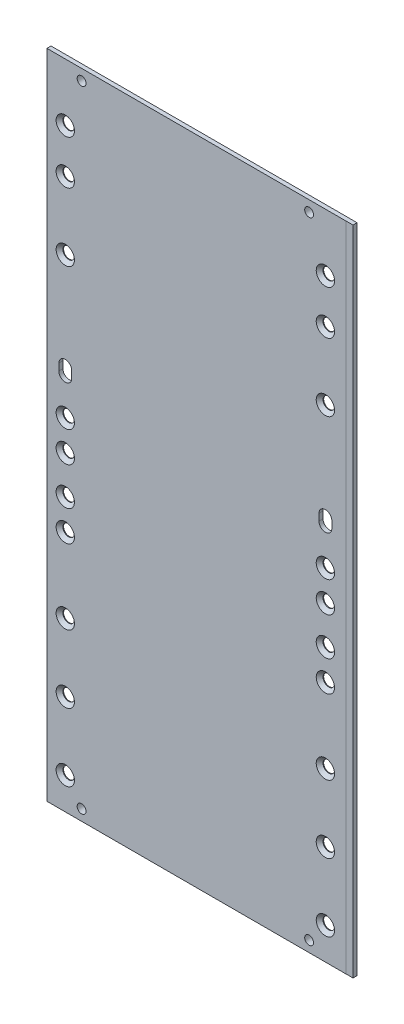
ISO-10303-21;
HEADER;
FILE_DESCRIPTION(('STEP AP214'),'2;1');
FILE_NAME('part.step','',(''),(''),'','','');
FILE_SCHEMA(('AUTOMOTIVE_DESIGN { 1 0 10303 214 1 1 1 1 }'));
ENDSEC;
DATA;
#1=APPLICATION_CONTEXT('core data for automotive mechanical design processes');
#2=APPLICATION_PROTOCOL_DEFINITION('international standard','automotive_design',2000,#1);
#3=PRODUCT_CONTEXT('',#1,'mechanical');
#4=PRODUCT('Part','Part','',(#3));
#5=PRODUCT_RELATED_PRODUCT_CATEGORY('part','',(#4));
#6=PRODUCT_DEFINITION_FORMATION('','',#4);
#7=PRODUCT_DEFINITION_CONTEXT('part definition',#1,'design');
#8=PRODUCT_DEFINITION('design','',#6,#7);
#9=PRODUCT_DEFINITION_SHAPE('','',#8);
#10=(LENGTH_UNIT() NAMED_UNIT(*) SI_UNIT(.MILLI.,.METRE.));
#11=(NAMED_UNIT(*) PLANE_ANGLE_UNIT() SI_UNIT($,.RADIAN.));
#12=(NAMED_UNIT(*) SI_UNIT($,.STERADIAN.) SOLID_ANGLE_UNIT());
#13=UNCERTAINTY_MEASURE_WITH_UNIT(LENGTH_MEASURE(1.E-05),#10,'distance_accuracy_value','');
#14=(GEOMETRIC_REPRESENTATION_CONTEXT(3) GLOBAL_UNCERTAINTY_ASSIGNED_CONTEXT((#13)) GLOBAL_UNIT_ASSIGNED_CONTEXT((#10,
#11,#12)) REPRESENTATION_CONTEXT('',''));
#15=CARTESIAN_POINT('',(0.,0.,0.));
#16=DIRECTION('',(0.,0.,1.));
#17=DIRECTION('',(1.,0.,0.));
#18=AXIS2_PLACEMENT_3D('',#15,#16,#17);
#19=CARTESIAN_POINT('',(0.,0.,0.));
#20=DIRECTION('',(0.,0.,1.));
#21=DIRECTION('',(1.,0.,0.));
#22=AXIS2_PLACEMENT_3D('',#19,#20,#21);
#23=PLANE('',#22);
#24=CARTESIAN_POINT('',(-36.4318840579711,3.97439613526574,0.));
#25=DIRECTION('',(0.,0.,1.));
#26=DIRECTION('',(1.,0.,0.));
#27=AXIS2_PLACEMENT_3D('',#24,#25,#26);
#28=CIRCLE('',#27,1.90000000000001);
#29=CARTESIAN_POINT('',(-34.5318840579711,3.97439613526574,0.));
#30=VERTEX_POINT('',#29);
#31=CARTESIAN_POINT('',(-38.3318840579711,3.97439613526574,0.));
#32=VERTEX_POINT('',#31);
#33=EDGE_CURVE('E402',#30,#32,#28,.T.);
#34=ORIENTED_EDGE('',*,*,#33,.T.);
#35=DIRECTION('',(0.,-1.,0.));
#36=VECTOR('',#35,1.);
#37=CARTESIAN_POINT('',(-38.3318840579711,3.97439613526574,0.));
#38=LINE('',#37,#36);
#39=CARTESIAN_POINT('',(-38.3318840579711,1.97439613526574,0.));
#40=VERTEX_POINT('',#39);
#41=EDGE_CURVE('E399',#32,#40,#38,.T.);
#42=ORIENTED_EDGE('',*,*,#41,.T.);
#43=CARTESIAN_POINT('',(-36.4318840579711,1.97439613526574,0.));
#44=DIRECTION('',(0.,0.,1.));
#45=DIRECTION('',(1.,0.,0.));
#46=AXIS2_PLACEMENT_3D('',#43,#44,#45);
#47=CIRCLE('',#46,1.90000000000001);
#48=CARTESIAN_POINT('',(-34.5318840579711,1.97439613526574,0.));
#49=VERTEX_POINT('',#48);
#50=EDGE_CURVE('E396',#40,#49,#47,.T.);
#51=ORIENTED_EDGE('',*,*,#50,.T.);
#52=DIRECTION('',(0.,1.,0.));
#53=VECTOR('',#52,1.);
#54=CARTESIAN_POINT('',(-34.5318840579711,3.97439613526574,0.));
#55=LINE('',#54,#53);
#56=EDGE_CURVE('E392',#49,#30,#55,.T.);
#57=ORIENTED_EDGE('',*,*,#56,.T.);
#58=EDGE_LOOP('',(#34,#42,#51,#57));
#59=FACE_BOUND('',#58,.T.);
#60=CARTESIAN_POINT('',(-36.4318840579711,65.5743961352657,0.));
#61=DIRECTION('',(0.,0.,1.));
#62=DIRECTION('',(1.,0.,0.));
#63=AXIS2_PLACEMENT_3D('',#60,#61,#62);
#64=CIRCLE('',#63,1.7);
#65=CARTESIAN_POINT('',(-34.7318840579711,65.5743961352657,0.));
#66=VERTEX_POINT('',#65);
#67=EDGE_CURVE('E351',#66,#66,#64,.T.);
#68=ORIENTED_EDGE('',*,*,#67,.T.);
#69=EDGE_LOOP('',(#68));
#70=FACE_BOUND('',#69,.T.);
#71=CARTESIAN_POINT('',(-36.4318840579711,52.5743961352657,0.));
#72=DIRECTION('',(0.,0.,1.));
#73=DIRECTION('',(1.,0.,0.));
#74=AXIS2_PLACEMENT_3D('',#71,#72,#73);
#75=CIRCLE('',#74,1.7);
#76=CARTESIAN_POINT('',(-34.7318840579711,52.5743961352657,0.));
#77=VERTEX_POINT('',#76);
#78=EDGE_CURVE('E354',#77,#77,#75,.T.);
#79=ORIENTED_EDGE('',*,*,#78,.T.);
#80=EDGE_LOOP('',(#79));
#81=FACE_BOUND('',#80,.T.);
#82=CARTESIAN_POINT('',(-36.4318840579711,32.5743961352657,0.));
#83=DIRECTION('',(0.,0.,1.));
#84=DIRECTION('',(1.,0.,0.));
#85=AXIS2_PLACEMENT_3D('',#82,#83,#84);
#86=CIRCLE('',#85,1.7);
#87=CARTESIAN_POINT('',(-34.7318840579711,32.5743961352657,0.));
#88=VERTEX_POINT('',#87);
#89=EDGE_CURVE('E357',#88,#88,#86,.T.);
#90=ORIENTED_EDGE('',*,*,#89,.T.);
#91=EDGE_LOOP('',(#90));
#92=FACE_BOUND('',#91,.T.);
#93=CARTESIAN_POINT('',(-36.4318840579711,-9.02560386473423,0.));
#94=DIRECTION('',(0.,0.,1.));
#95=DIRECTION('',(1.,0.,0.));
#96=AXIS2_PLACEMENT_3D('',#93,#94,#95);
#97=CIRCLE('',#96,1.7);
#98=CARTESIAN_POINT('',(-34.7318840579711,-9.02560386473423,0.));
#99=VERTEX_POINT('',#98);
#100=EDGE_CURVE('E360',#99,#99,#97,.T.);
#101=ORIENTED_EDGE('',*,*,#100,.T.);
#102=EDGE_LOOP('',(#101));
#103=FACE_BOUND('',#102,.T.);
#104=CARTESIAN_POINT('',(-36.4318840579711,-18.0256038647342,0.));
#105=DIRECTION('',(0.,0.,1.));
#106=DIRECTION('',(1.,0.,0.));
#107=AXIS2_PLACEMENT_3D('',#104,#105,#106);
#108=CIRCLE('',#107,1.7);
#109=CARTESIAN_POINT('',(-34.7318840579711,-18.0256038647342,0.));
#110=VERTEX_POINT('',#109);
#111=EDGE_CURVE('E363',#110,#110,#108,.T.);
#112=ORIENTED_EDGE('',*,*,#111,.T.);
#113=EDGE_LOOP('',(#112));
#114=FACE_BOUND('',#113,.T.);
#115=CARTESIAN_POINT('',(-36.4318840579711,-29.2256038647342,0.));
#116=DIRECTION('',(0.,0.,1.));
#117=DIRECTION('',(1.,0.,0.));
#118=AXIS2_PLACEMENT_3D('',#115,#116,#117);
#119=CIRCLE('',#118,1.7);
#120=CARTESIAN_POINT('',(-34.7318840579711,-29.2256038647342,0.));
#121=VERTEX_POINT('',#120);
#122=EDGE_CURVE('E366',#121,#121,#119,.T.);
#123=ORIENTED_EDGE('',*,*,#122,.T.);
#124=EDGE_LOOP('',(#123));
#125=FACE_BOUND('',#124,.T.);
#126=CARTESIAN_POINT('',(-36.4318840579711,-38.2256038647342,0.));
#127=DIRECTION('',(0.,0.,1.));
#128=DIRECTION('',(1.,0.,0.));
#129=AXIS2_PLACEMENT_3D('',#126,#127,#128);
#130=CIRCLE('',#129,1.7);
#131=CARTESIAN_POINT('',(-34.7318840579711,-38.2256038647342,0.));
#132=VERTEX_POINT('',#131);
#133=EDGE_CURVE('E369',#132,#132,#130,.T.);
#134=ORIENTED_EDGE('',*,*,#133,.T.);
#135=EDGE_LOOP('',(#134));
#136=FACE_BOUND('',#135,.T.);
#137=CARTESIAN_POINT('',(-36.4318840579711,-60.2256038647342,0.));
#138=DIRECTION('',(0.,0.,1.));
#139=DIRECTION('',(1.,0.,0.));
#140=AXIS2_PLACEMENT_3D('',#137,#138,#139);
#141=CIRCLE('',#140,1.7);
#142=CARTESIAN_POINT('',(-34.7318840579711,-60.2256038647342,0.));
#143=VERTEX_POINT('',#142);
#144=EDGE_CURVE('E372',#143,#143,#141,.T.);
#145=ORIENTED_EDGE('',*,*,#144,.T.);
#146=EDGE_LOOP('',(#145));
#147=FACE_BOUND('',#146,.T.);
#148=CARTESIAN_POINT('',(-36.4318840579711,-80.2256038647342,0.));
#149=DIRECTION('',(0.,0.,1.));
#150=DIRECTION('',(1.,0.,0.));
#151=AXIS2_PLACEMENT_3D('',#148,#149,#150);
#152=CIRCLE('',#151,1.7);
#153=CARTESIAN_POINT('',(-34.7318840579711,-80.2256038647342,0.));
#154=VERTEX_POINT('',#153);
#155=EDGE_CURVE('E375',#154,#154,#152,.T.);
#156=ORIENTED_EDGE('',*,*,#155,.T.);
#157=EDGE_LOOP('',(#156));
#158=FACE_BOUND('',#157,.T.);
#159=CARTESIAN_POINT('',(-36.4318840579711,-100.225603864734,0.));
#160=DIRECTION('',(0.,0.,1.));
#161=DIRECTION('',(1.,0.,0.));
#162=AXIS2_PLACEMENT_3D('',#159,#160,#161);
#163=CIRCLE('',#162,1.7);
#164=CARTESIAN_POINT('',(-34.7318840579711,-100.225603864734,0.));
#165=VERTEX_POINT('',#164);
#166=EDGE_CURVE('E378',#165,#165,#163,.T.);
#167=ORIENTED_EDGE('',*,*,#166,.T.);
#168=EDGE_LOOP('',(#167));
#169=FACE_BOUND('',#168,.T.);
#170=CARTESIAN_POINT('',(40.2318840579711,-100.225603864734,0.));
#171=DIRECTION('',(0.,0.,-1.));
#172=DIRECTION('',(-1.,0.,0.));
#173=AXIS2_PLACEMENT_3D('',#170,#171,#172);
#174=CIRCLE('',#173,1.7);
#175=CARTESIAN_POINT('',(38.5318840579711,-100.225603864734,0.));
#176=VERTEX_POINT('',#175);
#177=EDGE_CURVE('E80',#176,#176,#174,.T.);
#178=ORIENTED_EDGE('',*,*,#177,.F.);
#179=EDGE_LOOP('',(#178));
#180=FACE_BOUND('',#179,.T.);
#181=CARTESIAN_POINT('',(40.2318840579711,-80.2256038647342,0.));
#182=DIRECTION('',(0.,0.,-1.));
#183=DIRECTION('',(-1.,0.,0.));
#184=AXIS2_PLACEMENT_3D('',#181,#182,#183);
#185=CIRCLE('',#184,1.7);
#186=CARTESIAN_POINT('',(38.5318840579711,-80.2256038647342,0.));
#187=VERTEX_POINT('',#186);
#188=EDGE_CURVE('E275',#187,#187,#185,.T.);
#189=ORIENTED_EDGE('',*,*,#188,.F.);
#190=EDGE_LOOP('',(#189));
#191=FACE_BOUND('',#190,.T.);
#192=CARTESIAN_POINT('',(40.2318840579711,-60.2256038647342,0.));
#193=DIRECTION('',(0.,0.,-1.));
#194=DIRECTION('',(-1.,0.,0.));
#195=AXIS2_PLACEMENT_3D('',#192,#193,#194);
#196=CIRCLE('',#195,1.7);
#197=CARTESIAN_POINT('',(38.5318840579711,-60.2256038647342,0.));
#198=VERTEX_POINT('',#197);
#199=EDGE_CURVE('E272',#198,#198,#196,.T.);
#200=ORIENTED_EDGE('',*,*,#199,.F.);
#201=EDGE_LOOP('',(#200));
#202=FACE_BOUND('',#201,.T.);
#203=CARTESIAN_POINT('',(40.2318840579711,-38.2256038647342,0.));
#204=DIRECTION('',(0.,0.,-1.));
#205=DIRECTION('',(-1.,0.,0.));
#206=AXIS2_PLACEMENT_3D('',#203,#204,#205);
#207=CIRCLE('',#206,1.7);
#208=CARTESIAN_POINT('',(38.5318840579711,-38.2256038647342,0.));
#209=VERTEX_POINT('',#208);
#210=EDGE_CURVE('E269',#209,#209,#207,.T.);
#211=ORIENTED_EDGE('',*,*,#210,.F.);
#212=EDGE_LOOP('',(#211));
#213=FACE_BOUND('',#212,.T.);
#214=CARTESIAN_POINT('',(40.2318840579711,-29.2256038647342,0.));
#215=DIRECTION('',(0.,0.,-1.));
#216=DIRECTION('',(-1.,0.,0.));
#217=AXIS2_PLACEMENT_3D('',#214,#215,#216);
#218=CIRCLE('',#217,1.7);
#219=CARTESIAN_POINT('',(38.5318840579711,-29.2256038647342,0.));
#220=VERTEX_POINT('',#219);
#221=EDGE_CURVE('E266',#220,#220,#218,.T.);
#222=ORIENTED_EDGE('',*,*,#221,.F.);
#223=EDGE_LOOP('',(#222));
#224=FACE_BOUND('',#223,.T.);
#225=CARTESIAN_POINT('',(40.2318840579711,-18.0256038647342,0.));
#226=DIRECTION('',(0.,0.,-1.));
#227=DIRECTION('',(-1.,0.,0.));
#228=AXIS2_PLACEMENT_3D('',#225,#226,#227);
#229=CIRCLE('',#228,1.7);
#230=CARTESIAN_POINT('',(38.5318840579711,-18.0256038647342,0.));
#231=VERTEX_POINT('',#230);
#232=EDGE_CURVE('E263',#231,#231,#229,.T.);
#233=ORIENTED_EDGE('',*,*,#232,.F.);
#234=EDGE_LOOP('',(#233));
#235=FACE_BOUND('',#234,.T.);
#236=CARTESIAN_POINT('',(40.2318840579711,-9.02560386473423,0.));
#237=DIRECTION('',(0.,0.,-1.));
#238=DIRECTION('',(-1.,0.,0.));
#239=AXIS2_PLACEMENT_3D('',#236,#237,#238);
#240=CIRCLE('',#239,1.7);
#241=CARTESIAN_POINT('',(38.5318840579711,-9.02560386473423,0.));
#242=VERTEX_POINT('',#241);
#243=EDGE_CURVE('E260',#242,#242,#240,.T.);
#244=ORIENTED_EDGE('',*,*,#243,.F.);
#245=EDGE_LOOP('',(#244));
#246=FACE_BOUND('',#245,.T.);
#247=CARTESIAN_POINT('',(40.2318840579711,32.5743961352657,0.));
#248=DIRECTION('',(0.,0.,-1.));
#249=DIRECTION('',(-1.,0.,0.));
#250=AXIS2_PLACEMENT_3D('',#247,#248,#249);
#251=CIRCLE('',#250,1.7);
#252=CARTESIAN_POINT('',(38.5318840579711,32.5743961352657,0.));
#253=VERTEX_POINT('',#252);
#254=EDGE_CURVE('E225',#253,#253,#251,.T.);
#255=ORIENTED_EDGE('',*,*,#254,.F.);
#256=EDGE_LOOP('',(#255));
#257=FACE_BOUND('',#256,.T.);
#258=CARTESIAN_POINT('',(40.2318840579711,52.5743961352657,0.));
#259=DIRECTION('',(0.,0.,-1.));
#260=DIRECTION('',(-1.,0.,0.));
#261=AXIS2_PLACEMENT_3D('',#258,#259,#260);
#262=CIRCLE('',#261,1.7);
#263=CARTESIAN_POINT('',(38.5318840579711,52.5743961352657,0.));
#264=VERTEX_POINT('',#263);
#265=EDGE_CURVE('E222',#264,#264,#262,.T.);
#266=ORIENTED_EDGE('',*,*,#265,.F.);
#267=EDGE_LOOP('',(#266));
#268=FACE_BOUND('',#267,.T.);
#269=CARTESIAN_POINT('',(40.2318840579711,65.5743961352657,0.));
#270=DIRECTION('',(0.,0.,-1.));
#271=DIRECTION('',(-1.,0.,0.));
#272=AXIS2_PLACEMENT_3D('',#269,#270,#271);
#273=CIRCLE('',#272,1.7);
#274=CARTESIAN_POINT('',(38.5318840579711,65.5743961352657,0.));
#275=VERTEX_POINT('',#274);
#276=EDGE_CURVE('E219',#275,#275,#273,.T.);
#277=ORIENTED_EDGE('',*,*,#276,.F.);
#278=EDGE_LOOP('',(#277));
#279=FACE_BOUND('',#278,.T.);
#280=CARTESIAN_POINT('',(40.2318840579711,3.97439613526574,0.));
#281=DIRECTION('',(0.,0.,-1.));
#282=DIRECTION('',(-1.,0.,0.));
#283=AXIS2_PLACEMENT_3D('',#280,#281,#282);
#284=CIRCLE('',#283,1.90000000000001);
#285=CARTESIAN_POINT('',(38.3318840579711,3.97439613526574,0.));
#286=VERTEX_POINT('',#285);
#287=CARTESIAN_POINT('',(42.1318840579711,3.97439613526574,0.));
#288=VERTEX_POINT('',#287);
#289=EDGE_CURVE('E228',#286,#288,#284,.T.);
#290=ORIENTED_EDGE('',*,*,#289,.F.);
#291=DIRECTION('',(0.,1.,0.));
#292=VECTOR('',#291,1.);
#293=CARTESIAN_POINT('',(38.3318840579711,3.97439613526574,0.));
#294=LINE('',#293,#292);
#295=CARTESIAN_POINT('',(38.3318840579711,1.97439613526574,0.));
#296=VERTEX_POINT('',#295);
#297=EDGE_CURVE('E240',#296,#286,#294,.T.);
#298=ORIENTED_EDGE('',*,*,#297,.F.);
#299=CARTESIAN_POINT('',(40.2318840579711,1.97439613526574,0.));
#300=DIRECTION('',(0.,0.,-1.));
#301=DIRECTION('',(-1.,0.,0.));
#302=AXIS2_PLACEMENT_3D('',#299,#300,#301);
#303=CIRCLE('',#302,1.90000000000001);
#304=CARTESIAN_POINT('',(42.1318840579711,1.97439613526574,0.));
#305=VERTEX_POINT('',#304);
#306=EDGE_CURVE('E256',#305,#296,#303,.T.);
#307=ORIENTED_EDGE('',*,*,#306,.F.);
#308=DIRECTION('',(0.,-1.,0.));
#309=VECTOR('',#308,1.);
#310=CARTESIAN_POINT('',(42.1318840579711,3.97439613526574,0.));
#311=LINE('',#310,#309);
#312=EDGE_CURVE('E247',#288,#305,#311,.T.);
#313=ORIENTED_EDGE('',*,*,#312,.F.);
#314=EDGE_LOOP('',(#290,#298,#307,#313));
#315=FACE_BOUND('',#314,.T.);
#316=CARTESIAN_POINT('',(-31.6318840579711,79.3743961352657,0.));
#317=DIRECTION('',(0.,0.,1.));
#318=DIRECTION('',(1.,0.,0.));
#319=AXIS2_PLACEMENT_3D('',#316,#317,#318);
#320=CIRCLE('',#319,1.89999999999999);
#321=CARTESIAN_POINT('',(-29.7318840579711,79.3743961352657,0.));
#322=VERTEX_POINT('',#321);
#323=EDGE_CURVE('E311',#322,#322,#320,.T.);
#324=ORIENTED_EDGE('',*,*,#323,.T.);
#325=EDGE_LOOP('',(#324));
#326=FACE_BOUND('',#325,.T.);
#327=CARTESIAN_POINT('',(35.4318840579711,79.3743961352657,0.));
#328=DIRECTION('',(0.,0.,1.));
#329=DIRECTION('',(1.,0.,0.));
#330=AXIS2_PLACEMENT_3D('',#327,#328,#329);
#331=CIRCLE('',#330,1.89999999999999);
#332=CARTESIAN_POINT('',(37.3318840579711,79.3743961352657,0.));
#333=VERTEX_POINT('',#332);
#334=EDGE_CURVE('E315',#333,#333,#331,.T.);
#335=ORIENTED_EDGE('',*,*,#334,.T.);
#336=EDGE_LOOP('',(#335));
#337=FACE_BOUND('',#336,.T.);
#338=CARTESIAN_POINT('',(35.431884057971,-106.425603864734,0.));
#339=DIRECTION('',(0.,0.,1.));
#340=DIRECTION('',(1.,0.,0.));
#341=AXIS2_PLACEMENT_3D('',#338,#339,#340);
#342=CIRCLE('',#341,1.89999999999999);
#343=CARTESIAN_POINT('',(37.331884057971,-106.425603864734,0.));
#344=VERTEX_POINT('',#343);
#345=EDGE_CURVE('E319',#344,#344,#342,.T.);
#346=ORIENTED_EDGE('',*,*,#345,.T.);
#347=EDGE_LOOP('',(#346));
#348=FACE_BOUND('',#347,.T.);
#349=CARTESIAN_POINT('',(-31.631884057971,-106.425603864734,0.));
#350=DIRECTION('',(0.,0.,1.));
#351=DIRECTION('',(1.,0.,0.));
#352=AXIS2_PLACEMENT_3D('',#349,#350,#351);
#353=CIRCLE('',#352,1.89999999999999);
#354=CARTESIAN_POINT('',(-29.7318840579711,-106.425603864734,0.));
#355=VERTEX_POINT('',#354);
#356=EDGE_CURVE('E323',#355,#355,#353,.T.);
#357=ORIENTED_EDGE('',*,*,#356,.T.);
#358=EDGE_LOOP('',(#357));
#359=FACE_BOUND('',#358,.T.);
#360=DIRECTION('',(0.,-1.,0.));
#361=VECTOR('',#360,1.);
#362=CARTESIAN_POINT('',(46.368115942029,82.5743961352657,0.));
#363=LINE('',#362,#361);
#364=CARTESIAN_POINT('',(46.368115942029,82.5743961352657,0.));
#365=VERTEX_POINT('',#364);
#366=CARTESIAN_POINT('',(46.368115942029,-109.625603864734,0.));
#367=VERTEX_POINT('',#366);
#368=EDGE_CURVE('E200',#365,#367,#363,.T.);
#369=ORIENTED_EDGE('',*,*,#368,.T.);
#370=DIRECTION('',(1.,0.,0.));
#371=VECTOR('',#370,1.);
#372=CARTESIAN_POINT('',(-41.831884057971,-109.625603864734,0.));
#373=LINE('',#372,#371);
#374=CARTESIAN_POINT('',(-41.831884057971,-109.625603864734,0.));
#375=VERTEX_POINT('',#374);
#376=EDGE_CURVE('E328',#375,#367,#373,.T.);
#377=ORIENTED_EDGE('',*,*,#376,.F.);
#378=DIRECTION('',(0.,-1.,0.));
#379=VECTOR('',#378,1.);
#380=CARTESIAN_POINT('',(-41.8318840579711,82.5743961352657,0.));
#381=LINE('',#380,#379);
#382=CARTESIAN_POINT('',(-41.8318840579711,82.5743961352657,0.));
#383=VERTEX_POINT('',#382);
#384=EDGE_CURVE('E337',#383,#375,#381,.T.);
#385=ORIENTED_EDGE('',*,*,#384,.F.);
#386=DIRECTION('',(-1.,0.,0.));
#387=VECTOR('',#386,1.);
#388=CARTESIAN_POINT('',(-41.8318840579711,82.5743961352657,0.));
#389=LINE('',#388,#387);
#390=EDGE_CURVE('E329',#365,#383,#389,.T.);
#391=ORIENTED_EDGE('',*,*,#390,.F.);
#392=EDGE_LOOP('',(#369,#377,#385,#391));
#393=FACE_BOUND('',#392,.T.);
#394=ADVANCED_FACE('F72',(#59,#70,#81,#92,#103,#114,#125,#136,#147,#158,#169,#180,#191,#202,
#213,#224,#235,#246,#257,#268,#279,#315,#326,#337,#348,#359,#393),#23,.F.);
#395=CARTESIAN_POINT('',(-41.831884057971,-109.625603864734,1.2));
#396=DIRECTION('',(0.,1.,0.));
#397=DIRECTION('',(0.,0.,1.));
#398=AXIS2_PLACEMENT_3D('',#395,#396,#397);
#399=PLANE('',#398);
#400=DIRECTION('',(0.,0.,-1.));
#401=VECTOR('',#400,1.);
#402=CARTESIAN_POINT('',(46.368115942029,-109.625603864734,0.01));
#403=LINE('',#402,#401);
#404=CARTESIAN_POINT('',(46.368115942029,-109.625603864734,0.01));
#405=VERTEX_POINT('',#404);
#406=EDGE_CURVE('E334',#405,#367,#403,.T.);
#407=ORIENTED_EDGE('',*,*,#406,.F.);
#408=DIRECTION('',(1.,0.,0.));
#409=VECTOR('',#408,1.);
#410=CARTESIAN_POINT('',(48.368115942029,-109.625603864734,0.01));
#411=LINE('',#410,#409);
#412=CARTESIAN_POINT('',(48.368115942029,-109.625603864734,0.01));
#413=VERTEX_POINT('',#412);
#414=EDGE_CURVE('E579',#405,#413,#411,.T.);
#415=ORIENTED_EDGE('',*,*,#414,.T.);
#416=DIRECTION('',(0.,0.,-1.));
#417=VECTOR('',#416,1.);
#418=CARTESIAN_POINT('',(48.368115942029,-109.625603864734,1.2));
#419=LINE('',#418,#417);
#420=CARTESIAN_POINT('',(48.368115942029,-109.625603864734,1.19));
#421=VERTEX_POINT('',#420);
#422=EDGE_CURVE('E199',#421,#413,#419,.T.);
#423=ORIENTED_EDGE('',*,*,#422,.F.);
#424=DIRECTION('',(1.,0.,0.));
#425=VECTOR('',#424,1.);
#426=CARTESIAN_POINT('',(48.368115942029,-109.625603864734,1.19));
#427=LINE('',#426,#425);
#428=CARTESIAN_POINT('',(46.368115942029,-109.625603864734,1.19));
#429=VERTEX_POINT('',#428);
#430=EDGE_CURVE('E566',#429,#421,#427,.T.);
#431=ORIENTED_EDGE('',*,*,#430,.F.);
#432=DIRECTION('',(0.,0.,1.));
#433=VECTOR('',#432,1.);
#434=CARTESIAN_POINT('',(46.368115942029,-109.625603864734,1.19));
#435=LINE('',#434,#433);
#436=CARTESIAN_POINT('',(46.368115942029,-109.625603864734,1.2));
#437=VERTEX_POINT('',#436);
#438=EDGE_CURVE('E563',#429,#437,#435,.T.);
#439=ORIENTED_EDGE('',*,*,#438,.T.);
#440=DIRECTION('',(1.,0.,0.));
#441=VECTOR('',#440,1.);
#442=CARTESIAN_POINT('',(-41.831884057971,-109.625603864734,1.2));
#443=LINE('',#442,#441);
#444=CARTESIAN_POINT('',(-41.831884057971,-109.625603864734,1.2));
#445=VERTEX_POINT('',#444);
#446=EDGE_CURVE('E344',#445,#437,#443,.T.);
#447=ORIENTED_EDGE('',*,*,#446,.F.);
#448=DIRECTION('',(0.,0.,-1.));
#449=VECTOR('',#448,1.);
#450=CARTESIAN_POINT('',(-41.831884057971,-109.625603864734,1.2));
#451=LINE('',#450,#449);
#452=EDGE_CURVE('E207',#445,#375,#451,.T.);
#453=ORIENTED_EDGE('',*,*,#452,.T.);
#454=ORIENTED_EDGE('',*,*,#376,.T.);
#455=EDGE_LOOP('',(#407,#415,#423,#431,#439,#447,#453,#454));
#456=FACE_BOUND('',#455,.T.);
#457=ADVANCED_FACE('F284',(#456),#399,.F.);
#458=CARTESIAN_POINT('',(48.368115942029,82.5743961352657,1.2));
#459=DIRECTION('',(-1.,0.,0.));
#460=DIRECTION('',(0.,-1.,0.));
#461=AXIS2_PLACEMENT_3D('',#458,#459,#460);
#462=PLANE('',#461);
#463=DIRECTION('',(0.,1.,0.));
#464=VECTOR('',#463,1.);
#465=CARTESIAN_POINT('',(48.368115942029,82.5743961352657,0.01));
#466=LINE('',#465,#464);
#467=CARTESIAN_POINT('',(48.368115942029,82.5743961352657,0.01));
#468=VERTEX_POINT('',#467);
#469=EDGE_CURVE('E187',#413,#468,#466,.T.);
#470=ORIENTED_EDGE('',*,*,#469,.T.);
#471=DIRECTION('',(0.,0.,-1.));
#472=VECTOR('',#471,1.);
#473=CARTESIAN_POINT('',(48.368115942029,82.5743961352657,1.2));
#474=LINE('',#473,#472);
#475=CARTESIAN_POINT('',(48.368115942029,82.5743961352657,1.19));
#476=VERTEX_POINT('',#475);
#477=EDGE_CURVE('E197',#476,#468,#474,.T.);
#478=ORIENTED_EDGE('',*,*,#477,.F.);
#479=DIRECTION('',(0.,1.,0.));
#480=VECTOR('',#479,1.);
#481=CARTESIAN_POINT('',(48.368115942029,82.5743961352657,1.19));
#482=LINE('',#481,#480);
#483=EDGE_CURVE('E95',#421,#476,#482,.T.);
#484=ORIENTED_EDGE('',*,*,#483,.F.);
#485=ORIENTED_EDGE('',*,*,#422,.T.);
#486=EDGE_LOOP('',(#470,#478,#484,#485));
#487=FACE_BOUND('',#486,.T.);
#488=ADVANCED_FACE('F196',(#487),#462,.F.);
#489=CARTESIAN_POINT('',(-41.8318840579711,82.5743961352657,1.2));
#490=DIRECTION('',(0.,-1.,0.));
#491=DIRECTION('',(0.,0.,-1.));
#492=AXIS2_PLACEMENT_3D('',#489,#490,#491);
#493=PLANE('',#492);
#494=DIRECTION('',(0.,0.,-1.));
#495=VECTOR('',#494,1.);
#496=CARTESIAN_POINT('',(46.368115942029,82.5743961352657,0.01));
#497=LINE('',#496,#495);
#498=CARTESIAN_POINT('',(46.368115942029,82.5743961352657,0.01));
#499=VERTEX_POINT('',#498);
#500=EDGE_CURVE('E571',#499,#365,#497,.T.);
#501=ORIENTED_EDGE('',*,*,#500,.T.);
#502=ORIENTED_EDGE('',*,*,#390,.T.);
#503=DIRECTION('',(0.,0.,-1.));
#504=VECTOR('',#503,1.);
#505=CARTESIAN_POINT('',(-41.8318840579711,82.5743961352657,1.2));
#506=LINE('',#505,#504);
#507=CARTESIAN_POINT('',(-41.8318840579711,82.5743961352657,1.2));
#508=VERTEX_POINT('',#507);
#509=EDGE_CURVE('E205',#508,#383,#506,.T.);
#510=ORIENTED_EDGE('',*,*,#509,.F.);
#511=DIRECTION('',(-1.,0.,0.));
#512=VECTOR('',#511,1.);
#513=CARTESIAN_POINT('',(-41.8318840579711,82.5743961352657,1.2));
#514=LINE('',#513,#512);
#515=CARTESIAN_POINT('',(46.368115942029,82.5743961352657,1.2));
#516=VERTEX_POINT('',#515);
#517=EDGE_CURVE('E210',#516,#508,#514,.T.);
#518=ORIENTED_EDGE('',*,*,#517,.F.);
#519=DIRECTION('',(0.,0.,1.));
#520=VECTOR('',#519,1.);
#521=CARTESIAN_POINT('',(46.368115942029,82.5743961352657,1.19));
#522=LINE('',#521,#520);
#523=CARTESIAN_POINT('',(46.368115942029,82.5743961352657,1.19));
#524=VERTEX_POINT('',#523);
#525=EDGE_CURVE('E564',#524,#516,#522,.T.);
#526=ORIENTED_EDGE('',*,*,#525,.F.);
#527=DIRECTION('',(-1.,0.,0.));
#528=VECTOR('',#527,1.);
#529=CARTESIAN_POINT('',(48.368115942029,82.5743961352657,1.19));
#530=LINE('',#529,#528);
#531=EDGE_CURVE('E204',#476,#524,#530,.T.);
#532=ORIENTED_EDGE('',*,*,#531,.F.);
#533=ORIENTED_EDGE('',*,*,#477,.T.);
#534=DIRECTION('',(-1.,0.,0.));
#535=VECTOR('',#534,1.);
#536=CARTESIAN_POINT('',(48.368115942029,82.5743961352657,0.01));
#537=LINE('',#536,#535);
#538=EDGE_CURVE('E184',#468,#499,#537,.T.);
#539=ORIENTED_EDGE('',*,*,#538,.T.);
#540=EDGE_LOOP('',(#501,#502,#510,#518,#526,#532,#533,#539));
#541=FACE_BOUND('',#540,.T.);
#542=ADVANCED_FACE('F202',(#541),#493,.F.);
#543=CARTESIAN_POINT('',(-36.4318840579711,65.5743961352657,1.2));
#544=DIRECTION('',(0.,0.,-1.));
#545=DIRECTION('',(-1.,0.,0.));
#546=AXIS2_PLACEMENT_3D('',#543,#544,#545);
#547=CYLINDRICAL_SURFACE('',#546,1.7);
#548=ORIENTED_EDGE('',*,*,#67,.F.);
#549=EDGE_LOOP('',(#548));
#550=FACE_BOUND('',#549,.T.);
#551=CARTESIAN_POINT('',(-36.4318840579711,65.5743961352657,0.199999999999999));
#552=DIRECTION('',(0.,0.,1.));
#553=DIRECTION('',(1.,0.,0.));
#554=AXIS2_PLACEMENT_3D('',#551,#552,#553);
#555=CIRCLE('',#554,1.7);
#556=CARTESIAN_POINT('',(-34.7318840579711,65.5743961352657,0.199999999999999));
#557=VERTEX_POINT('',#556);
#558=EDGE_CURVE('E557',#557,#557,#555,.T.);
#559=ORIENTED_EDGE('',*,*,#558,.T.);
#560=EDGE_LOOP('',(#559));
#561=FACE_BOUND('',#560,.T.);
#562=ADVANCED_FACE('F791',(#550,#561),#547,.F.);
#563=CARTESIAN_POINT('',(-36.4318840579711,-38.2256038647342,1.2));
#564=DIRECTION('',(0.,0.,-1.));
#565=DIRECTION('',(-1.,0.,0.));
#566=AXIS2_PLACEMENT_3D('',#563,#564,#565);
#567=CYLINDRICAL_SURFACE('',#566,1.7);
#568=ORIENTED_EDGE('',*,*,#133,.F.);
#569=EDGE_LOOP('',(#568));
#570=FACE_BOUND('',#569,.T.);
#571=CARTESIAN_POINT('',(-36.4318840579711,-38.2256038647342,0.199999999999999));
#572=DIRECTION('',(0.,0.,1.));
#573=DIRECTION('',(1.,0.,0.));
#574=AXIS2_PLACEMENT_3D('',#571,#572,#573);
#575=CIRCLE('',#574,1.7);
#576=CARTESIAN_POINT('',(-34.7318840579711,-38.2256038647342,0.199999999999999));
#577=VERTEX_POINT('',#576);
#578=EDGE_CURVE('E521',#577,#577,#575,.T.);
#579=ORIENTED_EDGE('',*,*,#578,.T.);
#580=EDGE_LOOP('',(#579));
#581=FACE_BOUND('',#580,.T.);
#582=ADVANCED_FACE('F787',(#570,#581),#567,.F.);
#583=CARTESIAN_POINT('',(-36.4318840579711,-60.2256038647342,1.2));
#584=DIRECTION('',(0.,0.,-1.));
#585=DIRECTION('',(-1.,0.,0.));
#586=AXIS2_PLACEMENT_3D('',#583,#584,#585);
#587=CYLINDRICAL_SURFACE('',#586,1.7);
#588=ORIENTED_EDGE('',*,*,#144,.F.);
#589=EDGE_LOOP('',(#588));
#590=FACE_BOUND('',#589,.T.);
#591=CARTESIAN_POINT('',(-36.4318840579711,-60.2256038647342,0.199999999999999));
#592=DIRECTION('',(0.,0.,1.));
#593=DIRECTION('',(1.,0.,0.));
#594=AXIS2_PLACEMENT_3D('',#591,#592,#593);
#595=CIRCLE('',#594,1.7);
#596=CARTESIAN_POINT('',(-34.7318840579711,-60.2256038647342,0.199999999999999));
#597=VERTEX_POINT('',#596);
#598=EDGE_CURVE('E515',#597,#597,#595,.T.);
#599=ORIENTED_EDGE('',*,*,#598,.T.);
#600=EDGE_LOOP('',(#599));
#601=FACE_BOUND('',#600,.T.);
#602=ADVANCED_FACE('F779',(#590,#601),#587,.F.);
#603=CARTESIAN_POINT('',(-36.4318840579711,-100.225603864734,1.2));
#604=DIRECTION('',(0.,0.,-1.));
#605=DIRECTION('',(-1.,0.,0.));
#606=AXIS2_PLACEMENT_3D('',#603,#604,#605);
#607=CYLINDRICAL_SURFACE('',#606,1.7);
#608=ORIENTED_EDGE('',*,*,#166,.F.);
#609=EDGE_LOOP('',(#608));
#610=FACE_BOUND('',#609,.T.);
#611=CARTESIAN_POINT('',(-36.4318840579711,-100.225603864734,0.199999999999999));
#612=DIRECTION('',(0.,0.,1.));
#613=DIRECTION('',(1.,0.,0.));
#614=AXIS2_PLACEMENT_3D('',#611,#612,#613);
#615=CIRCLE('',#614,1.7);
#616=CARTESIAN_POINT('',(-34.7318840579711,-100.225603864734,0.199999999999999));
#617=VERTEX_POINT('',#616);
#618=EDGE_CURVE('E503',#617,#617,#615,.T.);
#619=ORIENTED_EDGE('',*,*,#618,.T.);
#620=EDGE_LOOP('',(#619));
#621=FACE_BOUND('',#620,.T.);
#622=ADVANCED_FACE('F664',(#610,#621),#607,.F.);
#623=CARTESIAN_POINT('',(40.2318840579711,-80.2256038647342,1.2));
#624=DIRECTION('',(0.,0.,-1.));
#625=DIRECTION('',(1.,0.,0.));
#626=AXIS2_PLACEMENT_3D('',#623,#624,#625);
#627=CYLINDRICAL_SURFACE('',#626,1.7);
#628=ORIENTED_EDGE('',*,*,#188,.T.);
#629=EDGE_LOOP('',(#628));
#630=FACE_BOUND('',#629,.T.);
#631=CARTESIAN_POINT('',(40.2318840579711,-80.2256038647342,0.199999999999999));
#632=DIRECTION('',(0.,0.,1.));
#633=DIRECTION('',(1.,0.,0.));
#634=AXIS2_PLACEMENT_3D('',#631,#632,#633);
#635=CIRCLE('',#634,1.7);
#636=CARTESIAN_POINT('',(41.9318840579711,-80.2256038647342,0.199999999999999));
#637=VERTEX_POINT('',#636);
#638=EDGE_CURVE('E491',#637,#637,#635,.T.);
#639=ORIENTED_EDGE('',*,*,#638,.T.);
#640=EDGE_LOOP('',(#639));
#641=FACE_BOUND('',#640,.T.);
#642=ADVANCED_FACE('F661',(#630,#641),#627,.F.);
#643=CARTESIAN_POINT('',(40.2318840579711,-60.2256038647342,1.2));
#644=DIRECTION('',(0.,0.,-1.));
#645=DIRECTION('',(1.,0.,0.));
#646=AXIS2_PLACEMENT_3D('',#643,#644,#645);
#647=CYLINDRICAL_SURFACE('',#646,1.7);
#648=ORIENTED_EDGE('',*,*,#199,.T.);
#649=EDGE_LOOP('',(#648));
#650=FACE_BOUND('',#649,.T.);
#651=CARTESIAN_POINT('',(40.2318840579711,-60.2256038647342,0.199999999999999));
#652=DIRECTION('',(0.,0.,1.));
#653=DIRECTION('',(1.,0.,0.));
#654=AXIS2_PLACEMENT_3D('',#651,#652,#653);
#655=CIRCLE('',#654,1.7);
#656=CARTESIAN_POINT('',(41.9318840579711,-60.2256038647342,0.199999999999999));
#657=VERTEX_POINT('',#656);
#658=EDGE_CURVE('E485',#657,#657,#655,.T.);
#659=ORIENTED_EDGE('',*,*,#658,.T.);
#660=EDGE_LOOP('',(#659));
#661=FACE_BOUND('',#660,.T.);
#662=ADVANCED_FACE('F657',(#650,#661),#647,.F.);
#663=CARTESIAN_POINT('',(40.2318840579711,-38.2256038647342,1.2));
#664=DIRECTION('',(0.,0.,-1.));
#665=DIRECTION('',(1.,0.,0.));
#666=AXIS2_PLACEMENT_3D('',#663,#664,#665);
#667=CYLINDRICAL_SURFACE('',#666,1.7);
#668=ORIENTED_EDGE('',*,*,#210,.T.);
#669=EDGE_LOOP('',(#668));
#670=FACE_BOUND('',#669,.T.);
#671=CARTESIAN_POINT('',(40.2318840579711,-38.2256038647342,0.199999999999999));
#672=DIRECTION('',(0.,0.,1.));
#673=DIRECTION('',(1.,0.,0.));
#674=AXIS2_PLACEMENT_3D('',#671,#672,#673);
#675=CIRCLE('',#674,1.7);
#676=CARTESIAN_POINT('',(41.9318840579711,-38.2256038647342,0.199999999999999));
#677=VERTEX_POINT('',#676);
#678=EDGE_CURVE('E479',#677,#677,#675,.T.);
#679=ORIENTED_EDGE('',*,*,#678,.T.);
#680=EDGE_LOOP('',(#679));
#681=FACE_BOUND('',#680,.T.);
#682=ADVANCED_FACE('F650',(#670,#681),#667,.F.);
#683=CARTESIAN_POINT('',(40.2318840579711,-18.0256038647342,1.2));
#684=DIRECTION('',(0.,0.,-1.));
#685=DIRECTION('',(1.,0.,0.));
#686=AXIS2_PLACEMENT_3D('',#683,#684,#685);
#687=CYLINDRICAL_SURFACE('',#686,1.7);
#688=ORIENTED_EDGE('',*,*,#232,.T.);
#689=EDGE_LOOP('',(#688));
#690=FACE_BOUND('',#689,.T.);
#691=CARTESIAN_POINT('',(40.2318840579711,-18.0256038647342,0.199999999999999));
#692=DIRECTION('',(0.,0.,1.));
#693=DIRECTION('',(1.,0.,0.));
#694=AXIS2_PLACEMENT_3D('',#691,#692,#693);
#695=CIRCLE('',#694,1.7);
#696=CARTESIAN_POINT('',(41.9318840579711,-18.0256038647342,0.199999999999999));
#697=VERTEX_POINT('',#696);
#698=EDGE_CURVE('E467',#697,#697,#695,.T.);
#699=ORIENTED_EDGE('',*,*,#698,.T.);
#700=EDGE_LOOP('',(#699));
#701=FACE_BOUND('',#700,.T.);
#702=ADVANCED_FACE('F646',(#690,#701),#687,.F.);
#703=CARTESIAN_POINT('',(40.2318840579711,-9.02560386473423,1.2));
#704=DIRECTION('',(0.,0.,-1.));
#705=DIRECTION('',(1.,0.,0.));
#706=AXIS2_PLACEMENT_3D('',#703,#704,#705);
#707=CYLINDRICAL_SURFACE('',#706,1.7);
#708=ORIENTED_EDGE('',*,*,#243,.T.);
#709=EDGE_LOOP('',(#708));
#710=FACE_BOUND('',#709,.T.);
#711=CARTESIAN_POINT('',(40.2318840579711,-9.02560386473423,0.199999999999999));
#712=DIRECTION('',(0.,0.,1.));
#713=DIRECTION('',(1.,0.,0.));
#714=AXIS2_PLACEMENT_3D('',#711,#712,#713);
#715=CIRCLE('',#714,1.7);
#716=CARTESIAN_POINT('',(41.9318840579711,-9.02560386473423,0.199999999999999));
#717=VERTEX_POINT('',#716);
#718=EDGE_CURVE('E461',#717,#717,#715,.T.);
#719=ORIENTED_EDGE('',*,*,#718,.T.);
#720=EDGE_LOOP('',(#719));
#721=FACE_BOUND('',#720,.T.);
#722=ADVANCED_FACE('F626',(#710,#721),#707,.F.);
#723=CARTESIAN_POINT('',(40.2318840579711,32.5743961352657,1.2));
#724=DIRECTION('',(0.,0.,-1.));
#725=DIRECTION('',(1.,0.,0.));
#726=AXIS2_PLACEMENT_3D('',#723,#724,#725);
#727=CYLINDRICAL_SURFACE('',#726,1.7);
#728=ORIENTED_EDGE('',*,*,#254,.T.);
#729=EDGE_LOOP('',(#728));
#730=FACE_BOUND('',#729,.T.);
#731=CARTESIAN_POINT('',(40.2318840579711,32.5743961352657,0.199999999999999));
#732=DIRECTION('',(0.,0.,1.));
#733=DIRECTION('',(1.,0.,0.));
#734=AXIS2_PLACEMENT_3D('',#731,#732,#733);
#735=CIRCLE('',#734,1.7);
#736=CARTESIAN_POINT('',(41.9318840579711,32.5743961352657,0.199999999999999));
#737=VERTEX_POINT('',#736);
#738=EDGE_CURVE('E455',#737,#737,#735,.T.);
#739=ORIENTED_EDGE('',*,*,#738,.T.);
#740=EDGE_LOOP('',(#739));
#741=FACE_BOUND('',#740,.T.);
#742=ADVANCED_FACE('F622',(#730,#741),#727,.F.);
#743=CARTESIAN_POINT('',(40.2318840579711,52.5743961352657,1.2));
#744=DIRECTION('',(0.,0.,-1.));
#745=DIRECTION('',(1.,0.,0.));
#746=AXIS2_PLACEMENT_3D('',#743,#744,#745);
#747=CYLINDRICAL_SURFACE('',#746,1.7);
#748=ORIENTED_EDGE('',*,*,#265,.T.);
#749=EDGE_LOOP('',(#748));
#750=FACE_BOUND('',#749,.T.);
#751=CARTESIAN_POINT('',(40.2318840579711,52.5743961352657,0.199999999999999));
#752=DIRECTION('',(0.,0.,1.));
#753=DIRECTION('',(1.,0.,0.));
#754=AXIS2_PLACEMENT_3D('',#751,#752,#753);
#755=CIRCLE('',#754,1.7);
#756=CARTESIAN_POINT('',(41.9318840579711,52.5743961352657,0.199999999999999));
#757=VERTEX_POINT('',#756);
#758=EDGE_CURVE('E449',#757,#757,#755,.T.);
#759=ORIENTED_EDGE('',*,*,#758,.T.);
#760=EDGE_LOOP('',(#759));
#761=FACE_BOUND('',#760,.T.);
#762=ADVANCED_FACE('F619',(#750,#761),#747,.F.);
#763=CARTESIAN_POINT('',(35.431884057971,-106.425603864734,1.2));
#764=DIRECTION('',(0.,0.,-1.));
#765=DIRECTION('',(1.,0.,0.));
#766=AXIS2_PLACEMENT_3D('',#763,#764,#765);
#767=CYLINDRICAL_SURFACE('',#766,1.29999999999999);
#768=CARTESIAN_POINT('',(35.431884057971,-106.425603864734,1.2));
#769=DIRECTION('',(0.,0.,-1.));
#770=DIRECTION('',(-1.,0.,0.));
#771=AXIS2_PLACEMENT_3D('',#768,#769,#770);
#772=CIRCLE('',#771,1.29999999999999);
#773=CARTESIAN_POINT('',(34.131884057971,-106.425603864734,1.2));
#774=VERTEX_POINT('',#773);
#775=EDGE_CURVE('E14',#774,#774,#772,.T.);
#776=ORIENTED_EDGE('',*,*,#775,.F.);
#777=EDGE_LOOP('',(#776));
#778=FACE_BOUND('',#777,.T.);
#779=CARTESIAN_POINT('',(35.431884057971,-106.425603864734,-1.));
#780=DIRECTION('',(0.,0.,1.));
#781=DIRECTION('',(1.,0.,0.));
#782=AXIS2_PLACEMENT_3D('',#779,#780,#781);
#783=CIRCLE('',#782,1.29999999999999);
#784=CARTESIAN_POINT('',(36.731884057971,-106.425603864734,-1.));
#785=VERTEX_POINT('',#784);
#786=EDGE_CURVE('E431',#785,#785,#783,.T.);
#787=ORIENTED_EDGE('',*,*,#786,.F.);
#788=EDGE_LOOP('',(#787));
#789=FACE_BOUND('',#788,.T.);
#790=ADVANCED_FACE('F74',(#778,#789),#767,.F.);
#791=CARTESIAN_POINT('',(40.2318840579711,-100.225603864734,1.2));
#792=DIRECTION('',(0.,0.,-1.));
#793=DIRECTION('',(1.,0.,0.));
#794=AXIS2_PLACEMENT_3D('',#791,#792,#793);
#795=CYLINDRICAL_SURFACE('',#794,1.7);
#796=CARTESIAN_POINT('',(40.2318840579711,-100.225603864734,0.199999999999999));
#797=DIRECTION('',(0.,0.,1.));
#798=DIRECTION('',(1.,0.,0.));
#799=AXIS2_PLACEMENT_3D('',#796,#797,#798);
#800=CIRCLE('',#799,1.7);
#801=CARTESIAN_POINT('',(41.9318840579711,-100.225603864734,0.199999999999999));
#802=VERTEX_POINT('',#801);
#803=EDGE_CURVE('E497',#802,#802,#800,.T.);
#804=ORIENTED_EDGE('',*,*,#803,.T.);
#805=EDGE_LOOP('',(#804));
#806=FACE_BOUND('',#805,.T.);
#807=ORIENTED_EDGE('',*,*,#177,.T.);
#808=EDGE_LOOP('',(#807));
#809=FACE_BOUND('',#808,.T.);
#810=ADVANCED_FACE('F280',(#806,#809),#795,.F.);
#811=CARTESIAN_POINT('',(40.2318840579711,-29.2256038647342,1.2));
#812=DIRECTION('',(0.,0.,-1.));
#813=DIRECTION('',(1.,0.,0.));
#814=AXIS2_PLACEMENT_3D('',#811,#812,#813);
#815=CYLINDRICAL_SURFACE('',#814,1.7);
#816=CARTESIAN_POINT('',(40.2318840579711,-29.2256038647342,0.199999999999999));
#817=DIRECTION('',(0.,0.,1.));
#818=DIRECTION('',(1.,0.,0.));
#819=AXIS2_PLACEMENT_3D('',#816,#817,#818);
#820=CIRCLE('',#819,1.7);
#821=CARTESIAN_POINT('',(41.9318840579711,-29.2256038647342,0.199999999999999));
#822=VERTEX_POINT('',#821);
#823=EDGE_CURVE('E473',#822,#822,#820,.T.);
#824=ORIENTED_EDGE('',*,*,#823,.T.);
#825=EDGE_LOOP('',(#824));
#826=FACE_BOUND('',#825,.T.);
#827=ORIENTED_EDGE('',*,*,#221,.T.);
#828=EDGE_LOOP('',(#827));
#829=FACE_BOUND('',#828,.T.);
#830=ADVANCED_FACE('F642',(#826,#829),#815,.F.);
#831=CARTESIAN_POINT('',(40.2318840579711,1.97439613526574,1.2));
#832=DIRECTION('',(0.,0.,-1.));
#833=DIRECTION('',(1.,0.,0.));
#834=AXIS2_PLACEMENT_3D('',#831,#832,#833);
#835=CYLINDRICAL_SURFACE('',#834,1.90000000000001);
#836=ORIENTED_EDGE('',*,*,#306,.T.);
#837=DIRECTION('',(0.,0.,-1.));
#838=VECTOR('',#837,1.);
#839=CARTESIAN_POINT('',(38.3318840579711,1.97439613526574,1.2));
#840=LINE('',#839,#838);
#841=CARTESIAN_POINT('',(38.3318840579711,1.97439613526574,1.2));
#842=VERTEX_POINT('',#841);
#843=EDGE_CURVE('E242',#842,#296,#840,.T.);
#844=ORIENTED_EDGE('',*,*,#843,.F.);
#845=CARTESIAN_POINT('',(40.2318840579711,1.97439613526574,1.2));
#846=DIRECTION('',(0.,0.,-1.));
#847=DIRECTION('',(-1.,0.,0.));
#848=AXIS2_PLACEMENT_3D('',#845,#846,#847);
#849=CIRCLE('',#848,1.90000000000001);
#850=CARTESIAN_POINT('',(42.1318840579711,1.97439613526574,1.2));
#851=VERTEX_POINT('',#850);
#852=EDGE_CURVE('E258',#851,#842,#849,.T.);
#853=ORIENTED_EDGE('',*,*,#852,.F.);
#854=DIRECTION('',(0.,0.,-1.));
#855=VECTOR('',#854,1.);
#856=CARTESIAN_POINT('',(42.1318840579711,1.97439613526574,1.2));
#857=LINE('',#856,#855);
#858=EDGE_CURVE('E253',#851,#305,#857,.T.);
#859=ORIENTED_EDGE('',*,*,#858,.T.);
#860=EDGE_LOOP('',(#836,#844,#853,#859));
#861=FACE_BOUND('',#860,.T.);
#862=ADVANCED_FACE('F638',(#861),#835,.F.);
#863=CARTESIAN_POINT('',(42.1318840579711,3.97439613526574,1.2));
#864=DIRECTION('',(-1.,0.,0.));
#865=DIRECTION('',(0.,0.,-1.));
#866=AXIS2_PLACEMENT_3D('',#863,#864,#865);
#867=PLANE('',#866);
#868=ORIENTED_EDGE('',*,*,#312,.T.);
#869=ORIENTED_EDGE('',*,*,#858,.F.);
#870=DIRECTION('',(0.,-1.,0.));
#871=VECTOR('',#870,1.);
#872=CARTESIAN_POINT('',(42.1318840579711,3.97439613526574,1.2));
#873=LINE('',#872,#871);
#874=CARTESIAN_POINT('',(42.1318840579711,3.97439613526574,1.2));
#875=VERTEX_POINT('',#874);
#876=EDGE_CURVE('E250',#875,#851,#873,.T.);
#877=ORIENTED_EDGE('',*,*,#876,.F.);
#878=DIRECTION('',(0.,0.,-1.));
#879=VECTOR('',#878,1.);
#880=CARTESIAN_POINT('',(42.1318840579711,3.97439613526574,1.2));
#881=LINE('',#880,#879);
#882=EDGE_CURVE('E237',#875,#288,#881,.T.);
#883=ORIENTED_EDGE('',*,*,#882,.T.);
#884=EDGE_LOOP('',(#868,#869,#877,#883));
#885=FACE_BOUND('',#884,.T.);
#886=ADVANCED_FACE('F634',(#885),#867,.T.);
#887=CARTESIAN_POINT('',(38.3318840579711,3.97439613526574,1.2));
#888=DIRECTION('',(1.,0.,0.));
#889=DIRECTION('',(0.,0.,1.));
#890=AXIS2_PLACEMENT_3D('',#887,#888,#889);
#891=PLANE('',#890);
#892=ORIENTED_EDGE('',*,*,#297,.T.);
#893=DIRECTION('',(0.,0.,-1.));
#894=VECTOR('',#893,1.);
#895=CARTESIAN_POINT('',(38.3318840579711,3.97439613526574,1.2));
#896=LINE('',#895,#894);
#897=CARTESIAN_POINT('',(38.3318840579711,3.97439613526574,1.2));
#898=VERTEX_POINT('',#897);
#899=EDGE_CURVE('E231',#898,#286,#896,.T.);
#900=ORIENTED_EDGE('',*,*,#899,.F.);
#901=DIRECTION('',(0.,1.,0.));
#902=VECTOR('',#901,1.);
#903=CARTESIAN_POINT('',(38.3318840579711,3.97439613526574,1.2));
#904=LINE('',#903,#902);
#905=EDGE_CURVE('E245',#842,#898,#904,.T.);
#906=ORIENTED_EDGE('',*,*,#905,.F.);
#907=ORIENTED_EDGE('',*,*,#843,.T.);
#908=EDGE_LOOP('',(#892,#900,#906,#907));
#909=FACE_BOUND('',#908,.T.);
#910=ADVANCED_FACE('F630',(#909),#891,.T.);
#911=CARTESIAN_POINT('',(40.2318840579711,3.97439613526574,1.2));
#912=DIRECTION('',(0.,0.,-1.));
#913=DIRECTION('',(1.,0.,0.));
#914=AXIS2_PLACEMENT_3D('',#911,#912,#913);
#915=CYLINDRICAL_SURFACE('',#914,1.90000000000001);
#916=ORIENTED_EDGE('',*,*,#289,.T.);
#917=ORIENTED_EDGE('',*,*,#882,.F.);
#918=CARTESIAN_POINT('',(40.2318840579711,3.97439613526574,1.2));
#919=DIRECTION('',(0.,0.,-1.));
#920=DIRECTION('',(-1.,0.,0.));
#921=AXIS2_PLACEMENT_3D('',#918,#919,#920);
#922=CIRCLE('',#921,1.90000000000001);
#923=EDGE_CURVE('E234',#898,#875,#922,.T.);
#924=ORIENTED_EDGE('',*,*,#923,.F.);
#925=ORIENTED_EDGE('',*,*,#899,.T.);
#926=EDGE_LOOP('',(#916,#917,#924,#925));
#927=FACE_BOUND('',#926,.T.);
#928=ADVANCED_FACE('F617',(#927),#915,.F.);
#929=CARTESIAN_POINT('',(40.2318840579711,65.5743961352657,1.2));
#930=DIRECTION('',(0.,0.,-1.));
#931=DIRECTION('',(1.,0.,0.));
#932=AXIS2_PLACEMENT_3D('',#929,#930,#931);
#933=CYLINDRICAL_SURFACE('',#932,1.7);
#934=CARTESIAN_POINT('',(40.2318840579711,65.5743961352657,0.199999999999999));
#935=DIRECTION('',(0.,0.,1.));
#936=DIRECTION('',(1.,0.,0.));
#937=AXIS2_PLACEMENT_3D('',#934,#935,#936);
#938=CIRCLE('',#937,1.7);
#939=CARTESIAN_POINT('',(41.9318840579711,65.5743961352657,0.199999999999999));
#940=VERTEX_POINT('',#939);
#941=EDGE_CURVE('E443',#940,#940,#938,.T.);
#942=ORIENTED_EDGE('',*,*,#941,.T.);
#943=EDGE_LOOP('',(#942));
#944=FACE_BOUND('',#943,.T.);
#945=ORIENTED_EDGE('',*,*,#276,.T.);
#946=EDGE_LOOP('',(#945));
#947=FACE_BOUND('',#946,.T.);
#948=ADVANCED_FACE('F613',(#944,#947),#933,.F.);
#949=CARTESIAN_POINT('',(35.4318840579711,79.3743961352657,1.2));
#950=DIRECTION('',(0.,0.,-1.));
#951=DIRECTION('',(1.,0.,0.));
#952=AXIS2_PLACEMENT_3D('',#949,#950,#951);
#953=CYLINDRICAL_SURFACE('',#952,1.29999999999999);
#954=CARTESIAN_POINT('',(35.4318840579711,79.3743961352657,1.2));
#955=DIRECTION('',(0.,0.,-1.));
#956=DIRECTION('',(-1.,0.,0.));
#957=AXIS2_PLACEMENT_3D('',#954,#955,#956);
#958=CIRCLE('',#957,1.29999999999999);
#959=CARTESIAN_POINT('',(34.1318840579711,79.3743961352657,1.2));
#960=VERTEX_POINT('',#959);
#961=EDGE_CURVE('E216',#960,#960,#958,.T.);
#962=ORIENTED_EDGE('',*,*,#961,.F.);
#963=EDGE_LOOP('',(#962));
#964=FACE_BOUND('',#963,.T.);
#965=CARTESIAN_POINT('',(35.4318840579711,79.3743961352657,-1.));
#966=DIRECTION('',(0.,0.,1.));
#967=DIRECTION('',(1.,0.,0.));
#968=AXIS2_PLACEMENT_3D('',#965,#966,#967);
#969=CIRCLE('',#968,1.29999999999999);
#970=CARTESIAN_POINT('',(36.7318840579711,79.3743961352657,-1.));
#971=VERTEX_POINT('',#970);
#972=EDGE_CURVE('E424',#971,#971,#969,.T.);
#973=ORIENTED_EDGE('',*,*,#972,.F.);
#974=EDGE_LOOP('',(#973));
#975=FACE_BOUND('',#974,.T.);
#976=ADVANCED_FACE('F606',(#964,#975),#953,.F.);
#977=CARTESIAN_POINT('',(0.,0.,1.2));
#978=DIRECTION('',(0.,0.,1.));
#979=DIRECTION('',(1.,0.,0.));
#980=AXIS2_PLACEMENT_3D('',#977,#978,#979);
#981=PLANE('',#980);
#982=DIRECTION('',(0.,-1.,0.));
#983=VECTOR('',#982,1.);
#984=CARTESIAN_POINT('',(46.368115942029,82.5743961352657,1.2));
#985=LINE('',#984,#983);
#986=EDGE_CURVE('E569',#516,#437,#985,.T.);
#987=ORIENTED_EDGE('',*,*,#986,.F.);
#988=ORIENTED_EDGE('',*,*,#517,.T.);
#989=DIRECTION('',(0.,-1.,0.));
#990=VECTOR('',#989,1.);
#991=CARTESIAN_POINT('',(-41.8318840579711,82.5743961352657,1.2));
#992=LINE('',#991,#990);
#993=EDGE_CURVE('E339',#508,#445,#992,.T.);
#994=ORIENTED_EDGE('',*,*,#993,.T.);
#995=ORIENTED_EDGE('',*,*,#446,.T.);
#996=EDGE_LOOP('',(#987,#988,#994,#995));
#997=FACE_BOUND('',#996,.T.);
#998=CARTESIAN_POINT('',(-36.4318840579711,65.5743961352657,1.2));
#999=DIRECTION('',(0.,0.,1.));
#1000=DIRECTION('',(1.,0.,0.));
#1001=AXIS2_PLACEMENT_3D('',#998,#999,#1000);
#1002=CIRCLE('',#1001,2.7);
#1003=CARTESIAN_POINT('',(-33.7318840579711,65.5743961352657,1.2));
#1004=VERTEX_POINT('',#1003);
#1005=EDGE_CURVE('E560',#1004,#1004,#1002,.T.);
#1006=ORIENTED_EDGE('',*,*,#1005,.F.);
#1007=EDGE_LOOP('',(#1006));
#1008=FACE_BOUND('',#1007,.T.);
#1009=CARTESIAN_POINT('',(-36.4318840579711,52.5743961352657,1.2));
#1010=DIRECTION('',(0.,0.,1.));
#1011=DIRECTION('',(1.,0.,0.));
#1012=AXIS2_PLACEMENT_3D('',#1009,#1010,#1011);
#1013=CIRCLE('',#1012,2.7);
#1014=CARTESIAN_POINT('',(-33.7318840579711,52.5743961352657,1.2));
#1015=VERTEX_POINT('',#1014);
#1016=EDGE_CURVE('E554',#1015,#1015,#1013,.T.);
#1017=ORIENTED_EDGE('',*,*,#1016,.F.);
#1018=EDGE_LOOP('',(#1017));
#1019=FACE_BOUND('',#1018,.T.);
#1020=CARTESIAN_POINT('',(-36.4318840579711,32.5743961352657,1.2));
#1021=DIRECTION('',(0.,0.,1.));
#1022=DIRECTION('',(1.,0.,0.));
#1023=AXIS2_PLACEMENT_3D('',#1020,#1021,#1022);
#1024=CIRCLE('',#1023,2.7);
#1025=CARTESIAN_POINT('',(-33.7318840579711,32.5743961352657,1.2));
#1026=VERTEX_POINT('',#1025);
#1027=EDGE_CURVE('E548',#1026,#1026,#1024,.T.);
#1028=ORIENTED_EDGE('',*,*,#1027,.F.);
#1029=EDGE_LOOP('',(#1028));
#1030=FACE_BOUND('',#1029,.T.);
#1031=CARTESIAN_POINT('',(-36.4318840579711,-9.02560386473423,1.2));
#1032=DIRECTION('',(0.,0.,1.));
#1033=DIRECTION('',(1.,0.,0.));
#1034=AXIS2_PLACEMENT_3D('',#1031,#1032,#1033);
#1035=CIRCLE('',#1034,2.7);
#1036=CARTESIAN_POINT('',(-33.7318840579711,-9.02560386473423,1.2));
#1037=VERTEX_POINT('',#1036);
#1038=EDGE_CURVE('E542',#1037,#1037,#1035,.T.);
#1039=ORIENTED_EDGE('',*,*,#1038,.F.);
#1040=EDGE_LOOP('',(#1039));
#1041=FACE_BOUND('',#1040,.T.);
#1042=CARTESIAN_POINT('',(-36.4318840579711,-18.0256038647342,1.2));
#1043=DIRECTION('',(0.,0.,1.));
#1044=DIRECTION('',(1.,0.,0.));
#1045=AXIS2_PLACEMENT_3D('',#1042,#1043,#1044);
#1046=CIRCLE('',#1045,2.7);
#1047=CARTESIAN_POINT('',(-33.7318840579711,-18.0256038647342,1.2));
#1048=VERTEX_POINT('',#1047);
#1049=EDGE_CURVE('E536',#1048,#1048,#1046,.T.);
#1050=ORIENTED_EDGE('',*,*,#1049,.F.);
#1051=EDGE_LOOP('',(#1050));
#1052=FACE_BOUND('',#1051,.T.);
#1053=CARTESIAN_POINT('',(-36.4318840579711,-29.2256038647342,1.2));
#1054=DIRECTION('',(0.,0.,1.));
#1055=DIRECTION('',(1.,0.,0.));
#1056=AXIS2_PLACEMENT_3D('',#1053,#1054,#1055);
#1057=CIRCLE('',#1056,2.7);
#1058=CARTESIAN_POINT('',(-33.7318840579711,-29.2256038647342,1.2));
#1059=VERTEX_POINT('',#1058);
#1060=EDGE_CURVE('E530',#1059,#1059,#1057,.T.);
#1061=ORIENTED_EDGE('',*,*,#1060,.F.);
#1062=EDGE_LOOP('',(#1061));
#1063=FACE_BOUND('',#1062,.T.);
#1064=CARTESIAN_POINT('',(-36.4318840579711,-38.2256038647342,1.2));
#1065=DIRECTION('',(0.,0.,1.));
#1066=DIRECTION('',(1.,0.,0.));
#1067=AXIS2_PLACEMENT_3D('',#1064,#1065,#1066);
#1068=CIRCLE('',#1067,2.7);
#1069=CARTESIAN_POINT('',(-33.7318840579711,-38.2256038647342,1.2));
#1070=VERTEX_POINT('',#1069);
#1071=EDGE_CURVE('E524',#1070,#1070,#1068,.T.);
#1072=ORIENTED_EDGE('',*,*,#1071,.F.);
#1073=EDGE_LOOP('',(#1072));
#1074=FACE_BOUND('',#1073,.T.);
#1075=CARTESIAN_POINT('',(-36.4318840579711,-60.2256038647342,1.2));
#1076=DIRECTION('',(0.,0.,1.));
#1077=DIRECTION('',(1.,0.,0.));
#1078=AXIS2_PLACEMENT_3D('',#1075,#1076,#1077);
#1079=CIRCLE('',#1078,2.7);
#1080=CARTESIAN_POINT('',(-33.7318840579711,-60.2256038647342,1.2));
#1081=VERTEX_POINT('',#1080);
#1082=EDGE_CURVE('E518',#1081,#1081,#1079,.T.);
#1083=ORIENTED_EDGE('',*,*,#1082,.F.);
#1084=EDGE_LOOP('',(#1083));
#1085=FACE_BOUND('',#1084,.T.);
#1086=CARTESIAN_POINT('',(-36.4318840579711,-80.2256038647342,1.2));
#1087=DIRECTION('',(0.,0.,1.));
#1088=DIRECTION('',(1.,0.,0.));
#1089=AXIS2_PLACEMENT_3D('',#1086,#1087,#1088);
#1090=CIRCLE('',#1089,2.7);
#1091=CARTESIAN_POINT('',(-33.7318840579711,-80.2256038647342,1.2));
#1092=VERTEX_POINT('',#1091);
#1093=EDGE_CURVE('E512',#1092,#1092,#1090,.T.);
#1094=ORIENTED_EDGE('',*,*,#1093,.F.);
#1095=EDGE_LOOP('',(#1094));
#1096=FACE_BOUND('',#1095,.T.);
#1097=CARTESIAN_POINT('',(-36.4318840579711,-100.225603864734,1.2));
#1098=DIRECTION('',(0.,0.,1.));
#1099=DIRECTION('',(1.,0.,0.));
#1100=AXIS2_PLACEMENT_3D('',#1097,#1098,#1099);
#1101=CIRCLE('',#1100,2.7);
#1102=CARTESIAN_POINT('',(-33.7318840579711,-100.225603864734,1.2));
#1103=VERTEX_POINT('',#1102);
#1104=EDGE_CURVE('E506',#1103,#1103,#1101,.T.);
#1105=ORIENTED_EDGE('',*,*,#1104,.F.);
#1106=EDGE_LOOP('',(#1105));
#1107=FACE_BOUND('',#1106,.T.);
#1108=CARTESIAN_POINT('',(40.2318840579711,-100.225603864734,1.2));
#1109=DIRECTION('',(0.,0.,1.));
#1110=DIRECTION('',(1.,0.,0.));
#1111=AXIS2_PLACEMENT_3D('',#1108,#1109,#1110);
#1112=CIRCLE('',#1111,2.7);
#1113=CARTESIAN_POINT('',(42.9318840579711,-100.225603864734,1.2));
#1114=VERTEX_POINT('',#1113);
#1115=EDGE_CURVE('E500',#1114,#1114,#1112,.T.);
#1116=ORIENTED_EDGE('',*,*,#1115,.F.);
#1117=EDGE_LOOP('',(#1116));
#1118=FACE_BOUND('',#1117,.T.);
#1119=CARTESIAN_POINT('',(40.2318840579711,-80.2256038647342,1.2));
#1120=DIRECTION('',(0.,0.,1.));
#1121=DIRECTION('',(1.,0.,0.));
#1122=AXIS2_PLACEMENT_3D('',#1119,#1120,#1121);
#1123=CIRCLE('',#1122,2.7);
#1124=CARTESIAN_POINT('',(42.9318840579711,-80.2256038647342,1.2));
#1125=VERTEX_POINT('',#1124);
#1126=EDGE_CURVE('E494',#1125,#1125,#1123,.T.);
#1127=ORIENTED_EDGE('',*,*,#1126,.F.);
#1128=EDGE_LOOP('',(#1127));
#1129=FACE_BOUND('',#1128,.T.);
#1130=CARTESIAN_POINT('',(40.2318840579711,-60.2256038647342,1.2));
#1131=DIRECTION('',(0.,0.,1.));
#1132=DIRECTION('',(1.,0.,0.));
#1133=AXIS2_PLACEMENT_3D('',#1130,#1131,#1132);
#1134=CIRCLE('',#1133,2.7);
#1135=CARTESIAN_POINT('',(42.9318840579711,-60.2256038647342,1.2));
#1136=VERTEX_POINT('',#1135);
#1137=EDGE_CURVE('E488',#1136,#1136,#1134,.T.);
#1138=ORIENTED_EDGE('',*,*,#1137,.F.);
#1139=EDGE_LOOP('',(#1138));
#1140=FACE_BOUND('',#1139,.T.);
#1141=CARTESIAN_POINT('',(40.2318840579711,-38.2256038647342,1.2));
#1142=DIRECTION('',(0.,0.,1.));
#1143=DIRECTION('',(1.,0.,0.));
#1144=AXIS2_PLACEMENT_3D('',#1141,#1142,#1143);
#1145=CIRCLE('',#1144,2.7);
#1146=CARTESIAN_POINT('',(42.9318840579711,-38.2256038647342,1.2));
#1147=VERTEX_POINT('',#1146);
#1148=EDGE_CURVE('E482',#1147,#1147,#1145,.T.);
#1149=ORIENTED_EDGE('',*,*,#1148,.F.);
#1150=EDGE_LOOP('',(#1149));
#1151=FACE_BOUND('',#1150,.T.);
#1152=CARTESIAN_POINT('',(40.2318840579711,-29.2256038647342,1.2));
#1153=DIRECTION('',(0.,0.,1.));
#1154=DIRECTION('',(1.,0.,0.));
#1155=AXIS2_PLACEMENT_3D('',#1152,#1153,#1154);
#1156=CIRCLE('',#1155,2.7);
#1157=CARTESIAN_POINT('',(42.9318840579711,-29.2256038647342,1.2));
#1158=VERTEX_POINT('',#1157);
#1159=EDGE_CURVE('E476',#1158,#1158,#1156,.T.);
#1160=ORIENTED_EDGE('',*,*,#1159,.F.);
#1161=EDGE_LOOP('',(#1160));
#1162=FACE_BOUND('',#1161,.T.);
#1163=CARTESIAN_POINT('',(40.2318840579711,-18.0256038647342,1.2));
#1164=DIRECTION('',(0.,0.,1.));
#1165=DIRECTION('',(1.,0.,0.));
#1166=AXIS2_PLACEMENT_3D('',#1163,#1164,#1165);
#1167=CIRCLE('',#1166,2.7);
#1168=CARTESIAN_POINT('',(42.9318840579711,-18.0256038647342,1.2));
#1169=VERTEX_POINT('',#1168);
#1170=EDGE_CURVE('E470',#1169,#1169,#1167,.T.);
#1171=ORIENTED_EDGE('',*,*,#1170,.F.);
#1172=EDGE_LOOP('',(#1171));
#1173=FACE_BOUND('',#1172,.T.);
#1174=CARTESIAN_POINT('',(40.2318840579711,-9.02560386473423,1.2));
#1175=DIRECTION('',(0.,0.,1.));
#1176=DIRECTION('',(1.,0.,0.));
#1177=AXIS2_PLACEMENT_3D('',#1174,#1175,#1176);
#1178=CIRCLE('',#1177,2.7);
#1179=CARTESIAN_POINT('',(42.9318840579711,-9.02560386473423,1.2));
#1180=VERTEX_POINT('',#1179);
#1181=EDGE_CURVE('E464',#1180,#1180,#1178,.T.);
#1182=ORIENTED_EDGE('',*,*,#1181,.F.);
#1183=EDGE_LOOP('',(#1182));
#1184=FACE_BOUND('',#1183,.T.);
#1185=CARTESIAN_POINT('',(40.2318840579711,32.5743961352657,1.2));
#1186=DIRECTION('',(0.,0.,1.));
#1187=DIRECTION('',(1.,0.,0.));
#1188=AXIS2_PLACEMENT_3D('',#1185,#1186,#1187);
#1189=CIRCLE('',#1188,2.7);
#1190=CARTESIAN_POINT('',(42.9318840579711,32.5743961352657,1.2));
#1191=VERTEX_POINT('',#1190);
#1192=EDGE_CURVE('E458',#1191,#1191,#1189,.T.);
#1193=ORIENTED_EDGE('',*,*,#1192,.F.);
#1194=EDGE_LOOP('',(#1193));
#1195=FACE_BOUND('',#1194,.T.);
#1196=CARTESIAN_POINT('',(40.2318840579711,52.5743961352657,1.2));
#1197=DIRECTION('',(0.,0.,1.));
#1198=DIRECTION('',(1.,0.,0.));
#1199=AXIS2_PLACEMENT_3D('',#1196,#1197,#1198);
#1200=CIRCLE('',#1199,2.7);
#1201=CARTESIAN_POINT('',(42.9318840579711,52.5743961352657,1.2));
#1202=VERTEX_POINT('',#1201);
#1203=EDGE_CURVE('E452',#1202,#1202,#1200,.T.);
#1204=ORIENTED_EDGE('',*,*,#1203,.F.);
#1205=EDGE_LOOP('',(#1204));
#1206=FACE_BOUND('',#1205,.T.);
#1207=CARTESIAN_POINT('',(40.2318840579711,65.5743961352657,1.2));
#1208=DIRECTION('',(0.,0.,1.));
#1209=DIRECTION('',(1.,0.,0.));
#1210=AXIS2_PLACEMENT_3D('',#1207,#1208,#1209);
#1211=CIRCLE('',#1210,2.7);
#1212=CARTESIAN_POINT('',(42.9318840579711,65.5743961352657,1.2));
#1213=VERTEX_POINT('',#1212);
#1214=EDGE_CURVE('E446',#1213,#1213,#1211,.T.);
#1215=ORIENTED_EDGE('',*,*,#1214,.F.);
#1216=EDGE_LOOP('',(#1215));
#1217=FACE_BOUND('',#1216,.T.);
#1218=ORIENTED_EDGE('',*,*,#775,.T.);
#1219=EDGE_LOOP('',(#1218));
#1220=FACE_BOUND('',#1219,.T.);
#1221=ORIENTED_EDGE('',*,*,#961,.T.);
#1222=EDGE_LOOP('',(#1221));
#1223=FACE_BOUND('',#1222,.T.);
#1224=ORIENTED_EDGE('',*,*,#876,.T.);
#1225=ORIENTED_EDGE('',*,*,#852,.T.);
#1226=ORIENTED_EDGE('',*,*,#905,.T.);
#1227=ORIENTED_EDGE('',*,*,#923,.T.);
#1228=EDGE_LOOP('',(#1224,#1225,#1226,#1227));
#1229=FACE_BOUND('',#1228,.T.);
#1230=DIRECTION('',(0.,-1.,0.));
#1231=VECTOR('',#1230,1.);
#1232=CARTESIAN_POINT('',(-38.3318840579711,3.97439613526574,1.2));
#1233=LINE('',#1232,#1231);
#1234=CARTESIAN_POINT('',(-38.3318840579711,3.97439613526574,1.2));
#1235=VERTEX_POINT('',#1234);
#1236=CARTESIAN_POINT('',(-38.3318840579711,1.97439613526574,1.2));
#1237=VERTEX_POINT('',#1236);
#1238=EDGE_CURVE('E410',#1235,#1237,#1233,.T.);
#1239=ORIENTED_EDGE('',*,*,#1238,.F.);
#1240=CARTESIAN_POINT('',(-36.4318840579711,3.97439613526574,1.2));
#1241=DIRECTION('',(0.,0.,1.));
#1242=DIRECTION('',(1.,0.,0.));
#1243=AXIS2_PLACEMENT_3D('',#1240,#1241,#1242);
#1244=CIRCLE('',#1243,1.90000000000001);
#1245=CARTESIAN_POINT('',(-34.5318840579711,3.97439613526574,1.2));
#1246=VERTEX_POINT('',#1245);
#1247=EDGE_CURVE('E395',#1246,#1235,#1244,.T.);
#1248=ORIENTED_EDGE('',*,*,#1247,.F.);
#1249=DIRECTION('',(0.,1.,0.));
#1250=VECTOR('',#1249,1.);
#1251=CARTESIAN_POINT('',(-34.5318840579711,3.97439613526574,1.2));
#1252=LINE('',#1251,#1250);
#1253=CARTESIAN_POINT('',(-34.5318840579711,1.97439613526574,1.2));
#1254=VERTEX_POINT('',#1253);
#1255=EDGE_CURVE('E391',#1254,#1246,#1252,.T.);
#1256=ORIENTED_EDGE('',*,*,#1255,.F.);
#1257=CARTESIAN_POINT('',(-36.4318840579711,1.97439613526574,1.2));
#1258=DIRECTION('',(0.,0.,1.));
#1259=DIRECTION('',(1.,0.,0.));
#1260=AXIS2_PLACEMENT_3D('',#1257,#1258,#1259);
#1261=CIRCLE('',#1260,1.90000000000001);
#1262=EDGE_CURVE('E407',#1237,#1254,#1261,.T.);
#1263=ORIENTED_EDGE('',*,*,#1262,.F.);
#1264=EDGE_LOOP('',(#1239,#1248,#1256,#1263));
#1265=FACE_BOUND('',#1264,.T.);
#1266=CARTESIAN_POINT('',(-31.6318840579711,79.3743961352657,1.2));
#1267=DIRECTION('',(0.,0.,1.));
#1268=DIRECTION('',(1.,0.,0.));
#1269=AXIS2_PLACEMENT_3D('',#1266,#1267,#1268);
#1270=CIRCLE('',#1269,1.29999999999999);
#1271=CARTESIAN_POINT('',(-30.3318840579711,79.3743961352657,1.2));
#1272=VERTEX_POINT('',#1271);
#1273=EDGE_CURVE('E340',#1272,#1272,#1270,.T.);
#1274=ORIENTED_EDGE('',*,*,#1273,.F.);
#1275=EDGE_LOOP('',(#1274));
#1276=FACE_BOUND('',#1275,.T.);
#1277=CARTESIAN_POINT('',(-31.631884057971,-106.425603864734,1.2));
#1278=DIRECTION('',(0.,0.,1.));
#1279=DIRECTION('',(1.,0.,0.));
#1280=AXIS2_PLACEMENT_3D('',#1277,#1278,#1279);
#1281=CIRCLE('',#1280,1.29999999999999);
#1282=CARTESIAN_POINT('',(-30.3318840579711,-106.425603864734,1.2));
#1283=VERTEX_POINT('',#1282);
#1284=EDGE_CURVE('E405',#1283,#1283,#1281,.T.);
#1285=ORIENTED_EDGE('',*,*,#1284,.F.);
#1286=EDGE_LOOP('',(#1285));
#1287=FACE_BOUND('',#1286,.T.);
#1288=ADVANCED_FACE('F590',(#997,#1008,#1019,#1030,#1041,#1052,#1063,#1074,#1085,#1096,#1107,
#1118,#1129,#1140,#1151,#1162,#1173,#1184,#1195,#1206,#1217,#1220,#1223,#1229,#1265,#1276,
#1287),#981,.T.);
#1289=CARTESIAN_POINT('',(-41.8318840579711,82.5743961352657,1.2));
#1290=DIRECTION('',(1.,0.,0.));
#1291=DIRECTION('',(0.,1.,0.));
#1292=AXIS2_PLACEMENT_3D('',#1289,#1290,#1291);
#1293=PLANE('',#1292);
#1294=ORIENTED_EDGE('',*,*,#384,.T.);
#1295=ORIENTED_EDGE('',*,*,#452,.F.);
#1296=ORIENTED_EDGE('',*,*,#993,.F.);
#1297=ORIENTED_EDGE('',*,*,#509,.T.);
#1298=EDGE_LOOP('',(#1294,#1295,#1296,#1297));
#1299=FACE_BOUND('',#1298,.T.);
#1300=ADVANCED_FACE('F595',(#1299),#1293,.F.);
#1301=CARTESIAN_POINT('',(-31.6318840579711,79.3743961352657,1.2));
#1302=DIRECTION('',(0.,0.,-1.));
#1303=DIRECTION('',(-1.,0.,0.));
#1304=AXIS2_PLACEMENT_3D('',#1301,#1302,#1303);
#1305=CYLINDRICAL_SURFACE('',#1304,1.29999999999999);
#1306=ORIENTED_EDGE('',*,*,#1273,.T.);
#1307=EDGE_LOOP('',(#1306));
#1308=FACE_BOUND('',#1307,.T.);
#1309=CARTESIAN_POINT('',(-31.6318840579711,79.3743961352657,-1.));
#1310=DIRECTION('',(0.,0.,1.));
#1311=DIRECTION('',(1.,0.,0.));
#1312=AXIS2_PLACEMENT_3D('',#1309,#1310,#1311);
#1313=CIRCLE('',#1312,1.29999999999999);
#1314=CARTESIAN_POINT('',(-30.3318840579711,79.3743961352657,-1.));
#1315=VERTEX_POINT('',#1314);
#1316=EDGE_CURVE('E417',#1315,#1315,#1313,.T.);
#1317=ORIENTED_EDGE('',*,*,#1316,.F.);
#1318=EDGE_LOOP('',(#1317));
#1319=FACE_BOUND('',#1318,.T.);
#1320=ADVANCED_FACE('F597',(#1308,#1319),#1305,.F.);
#1321=CARTESIAN_POINT('',(-36.4318840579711,52.5743961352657,1.2));
#1322=DIRECTION('',(0.,0.,-1.));
#1323=DIRECTION('',(-1.,0.,0.));
#1324=AXIS2_PLACEMENT_3D('',#1321,#1322,#1323);
#1325=CYLINDRICAL_SURFACE('',#1324,1.7);
#1326=CARTESIAN_POINT('',(-36.4318840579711,52.5743961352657,0.199999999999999));
#1327=DIRECTION('',(0.,0.,1.));
#1328=DIRECTION('',(1.,0.,0.));
#1329=AXIS2_PLACEMENT_3D('',#1326,#1327,#1328);
#1330=CIRCLE('',#1329,1.7);
#1331=CARTESIAN_POINT('',(-34.7318840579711,52.5743961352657,0.199999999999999));
#1332=VERTEX_POINT('',#1331);
#1333=EDGE_CURVE('E551',#1332,#1332,#1330,.T.);
#1334=ORIENTED_EDGE('',*,*,#1333,.T.);
#1335=EDGE_LOOP('',(#1334));
#1336=FACE_BOUND('',#1335,.T.);
#1337=ORIENTED_EDGE('',*,*,#78,.F.);
#1338=EDGE_LOOP('',(#1337));
#1339=FACE_BOUND('',#1338,.T.);
#1340=ADVANCED_FACE('F603',(#1336,#1339),#1325,.F.);
#1341=CARTESIAN_POINT('',(-36.4318840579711,32.5743961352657,1.2));
#1342=DIRECTION('',(0.,0.,-1.));
#1343=DIRECTION('',(-1.,0.,0.));
#1344=AXIS2_PLACEMENT_3D('',#1341,#1342,#1343);
#1345=CYLINDRICAL_SURFACE('',#1344,1.7);
#1346=CARTESIAN_POINT('',(-36.4318840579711,32.5743961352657,0.199999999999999));
#1347=DIRECTION('',(0.,0.,1.));
#1348=DIRECTION('',(1.,0.,0.));
#1349=AXIS2_PLACEMENT_3D('',#1346,#1347,#1348);
#1350=CIRCLE('',#1349,1.7);
#1351=CARTESIAN_POINT('',(-34.7318840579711,32.5743961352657,0.199999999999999));
#1352=VERTEX_POINT('',#1351);
#1353=EDGE_CURVE('E545',#1352,#1352,#1350,.T.);
#1354=ORIENTED_EDGE('',*,*,#1353,.T.);
#1355=EDGE_LOOP('',(#1354));
#1356=FACE_BOUND('',#1355,.T.);
#1357=ORIENTED_EDGE('',*,*,#89,.F.);
#1358=EDGE_LOOP('',(#1357));
#1359=FACE_BOUND('',#1358,.T.);
#1360=ADVANCED_FACE('F803',(#1356,#1359),#1345,.F.);
#1361=CARTESIAN_POINT('',(-36.4318840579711,-9.02560386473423,1.2));
#1362=DIRECTION('',(0.,0.,-1.));
#1363=DIRECTION('',(-1.,0.,0.));
#1364=AXIS2_PLACEMENT_3D('',#1361,#1362,#1363);
#1365=CYLINDRICAL_SURFACE('',#1364,1.7);
#1366=CARTESIAN_POINT('',(-36.4318840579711,-9.02560386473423,0.199999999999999));
#1367=DIRECTION('',(0.,0.,1.));
#1368=DIRECTION('',(1.,0.,0.));
#1369=AXIS2_PLACEMENT_3D('',#1366,#1367,#1368);
#1370=CIRCLE('',#1369,1.7);
#1371=CARTESIAN_POINT('',(-34.7318840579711,-9.02560386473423,0.199999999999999));
#1372=VERTEX_POINT('',#1371);
#1373=EDGE_CURVE('E539',#1372,#1372,#1370,.T.);
#1374=ORIENTED_EDGE('',*,*,#1373,.T.);
#1375=EDGE_LOOP('',(#1374));
#1376=FACE_BOUND('',#1375,.T.);
#1377=ORIENTED_EDGE('',*,*,#100,.F.);
#1378=EDGE_LOOP('',(#1377));
#1379=FACE_BOUND('',#1378,.T.);
#1380=ADVANCED_FACE('F799',(#1376,#1379),#1365,.F.);
#1381=CARTESIAN_POINT('',(-36.4318840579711,-18.0256038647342,1.2));
#1382=DIRECTION('',(0.,0.,-1.));
#1383=DIRECTION('',(-1.,0.,0.));
#1384=AXIS2_PLACEMENT_3D('',#1381,#1382,#1383);
#1385=CYLINDRICAL_SURFACE('',#1384,1.7);
#1386=CARTESIAN_POINT('',(-36.4318840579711,-18.0256038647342,0.199999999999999));
#1387=DIRECTION('',(0.,0.,1.));
#1388=DIRECTION('',(1.,0.,0.));
#1389=AXIS2_PLACEMENT_3D('',#1386,#1387,#1388);
#1390=CIRCLE('',#1389,1.7);
#1391=CARTESIAN_POINT('',(-34.7318840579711,-18.0256038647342,0.199999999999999));
#1392=VERTEX_POINT('',#1391);
#1393=EDGE_CURVE('E533',#1392,#1392,#1390,.T.);
#1394=ORIENTED_EDGE('',*,*,#1393,.T.);
#1395=EDGE_LOOP('',(#1394));
#1396=FACE_BOUND('',#1395,.T.);
#1397=ORIENTED_EDGE('',*,*,#111,.F.);
#1398=EDGE_LOOP('',(#1397));
#1399=FACE_BOUND('',#1398,.T.);
#1400=ADVANCED_FACE('F795',(#1396,#1399),#1385,.F.);
#1401=CARTESIAN_POINT('',(-36.4318840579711,-29.2256038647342,1.2));
#1402=DIRECTION('',(0.,0.,-1.));
#1403=DIRECTION('',(-1.,0.,0.));
#1404=AXIS2_PLACEMENT_3D('',#1401,#1402,#1403);
#1405=CYLINDRICAL_SURFACE('',#1404,1.7);
#1406=CARTESIAN_POINT('',(-36.4318840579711,-29.2256038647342,0.199999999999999));
#1407=DIRECTION('',(0.,0.,1.));
#1408=DIRECTION('',(1.,0.,0.));
#1409=AXIS2_PLACEMENT_3D('',#1406,#1407,#1408);
#1410=CIRCLE('',#1409,1.7);
#1411=CARTESIAN_POINT('',(-34.7318840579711,-29.2256038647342,0.199999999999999));
#1412=VERTEX_POINT('',#1411);
#1413=EDGE_CURVE('E527',#1412,#1412,#1410,.T.);
#1414=ORIENTED_EDGE('',*,*,#1413,.T.);
#1415=EDGE_LOOP('',(#1414));
#1416=FACE_BOUND('',#1415,.T.);
#1417=ORIENTED_EDGE('',*,*,#122,.F.);
#1418=EDGE_LOOP('',(#1417));
#1419=FACE_BOUND('',#1418,.T.);
#1420=ADVANCED_FACE('F783',(#1416,#1419),#1405,.F.);
#1421=CARTESIAN_POINT('',(-36.4318840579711,-80.2256038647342,1.2));
#1422=DIRECTION('',(0.,0.,-1.));
#1423=DIRECTION('',(-1.,0.,0.));
#1424=AXIS2_PLACEMENT_3D('',#1421,#1422,#1423);
#1425=CYLINDRICAL_SURFACE('',#1424,1.7);
#1426=CARTESIAN_POINT('',(-36.4318840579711,-80.2256038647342,0.199999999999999));
#1427=DIRECTION('',(0.,0.,1.));
#1428=DIRECTION('',(1.,0.,0.));
#1429=AXIS2_PLACEMENT_3D('',#1426,#1427,#1428);
#1430=CIRCLE('',#1429,1.7);
#1431=CARTESIAN_POINT('',(-34.7318840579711,-80.2256038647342,0.199999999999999));
#1432=VERTEX_POINT('',#1431);
#1433=EDGE_CURVE('E509',#1432,#1432,#1430,.T.);
#1434=ORIENTED_EDGE('',*,*,#1433,.T.);
#1435=EDGE_LOOP('',(#1434));
#1436=FACE_BOUND('',#1435,.T.);
#1437=ORIENTED_EDGE('',*,*,#155,.F.);
#1438=EDGE_LOOP('',(#1437));
#1439=FACE_BOUND('',#1438,.T.);
#1440=ADVANCED_FACE('F775',(#1436,#1439),#1425,.F.);
#1441=CARTESIAN_POINT('',(-36.4318840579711,3.97439613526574,1.2));
#1442=DIRECTION('',(0.,0.,-1.));
#1443=DIRECTION('',(-1.,0.,0.));
#1444=AXIS2_PLACEMENT_3D('',#1441,#1442,#1443);
#1445=CYLINDRICAL_SURFACE('',#1444,1.90000000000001);
#1446=ORIENTED_EDGE('',*,*,#33,.F.);
#1447=DIRECTION('',(0.,0.,-1.));
#1448=VECTOR('',#1447,1.);
#1449=CARTESIAN_POINT('',(-34.5318840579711,3.97439613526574,1.2));
#1450=LINE('',#1449,#1448);
#1451=EDGE_CURVE('E388',#1246,#30,#1450,.T.);
#1452=ORIENTED_EDGE('',*,*,#1451,.F.);
#1453=ORIENTED_EDGE('',*,*,#1247,.T.);
#1454=DIRECTION('',(0.,0.,-1.));
#1455=VECTOR('',#1454,1.);
#1456=CARTESIAN_POINT('',(-38.3318840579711,3.97439613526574,1.2));
#1457=LINE('',#1456,#1455);
#1458=EDGE_CURVE('E381',#1235,#32,#1457,.T.);
#1459=ORIENTED_EDGE('',*,*,#1458,.T.);
#1460=EDGE_LOOP('',(#1446,#1452,#1453,#1459));
#1461=FACE_BOUND('',#1460,.T.);
#1462=ADVANCED_FACE('F771',(#1461),#1445,.F.);
#1463=CARTESIAN_POINT('',(-38.3318840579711,3.97439613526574,1.2));
#1464=DIRECTION('',(1.,0.,0.));
#1465=DIRECTION('',(0.,0.,-1.));
#1466=AXIS2_PLACEMENT_3D('',#1463,#1464,#1465);
#1467=PLANE('',#1466);
#1468=ORIENTED_EDGE('',*,*,#41,.F.);
#1469=ORIENTED_EDGE('',*,*,#1458,.F.);
#1470=ORIENTED_EDGE('',*,*,#1238,.T.);
#1471=DIRECTION('',(0.,0.,-1.));
#1472=VECTOR('',#1471,1.);
#1473=CARTESIAN_POINT('',(-38.3318840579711,1.97439613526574,1.2));
#1474=LINE('',#1473,#1472);
#1475=EDGE_CURVE('E384',#1237,#40,#1474,.T.);
#1476=ORIENTED_EDGE('',*,*,#1475,.T.);
#1477=EDGE_LOOP('',(#1468,#1469,#1470,#1476));
#1478=FACE_BOUND('',#1477,.T.);
#1479=ADVANCED_FACE('F767',(#1478),#1467,.T.);
#1480=CARTESIAN_POINT('',(-36.4318840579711,1.97439613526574,1.2));
#1481=DIRECTION('',(0.,0.,-1.));
#1482=DIRECTION('',(-1.,0.,0.));
#1483=AXIS2_PLACEMENT_3D('',#1480,#1481,#1482);
#1484=CYLINDRICAL_SURFACE('',#1483,1.90000000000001);
#1485=ORIENTED_EDGE('',*,*,#50,.F.);
#1486=ORIENTED_EDGE('',*,*,#1475,.F.);
#1487=ORIENTED_EDGE('',*,*,#1262,.T.);
#1488=DIRECTION('',(0.,0.,-1.));
#1489=VECTOR('',#1488,1.);
#1490=CARTESIAN_POINT('',(-34.5318840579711,1.97439613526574,1.2));
#1491=LINE('',#1490,#1489);
#1492=EDGE_CURVE('E386',#1254,#49,#1491,.T.);
#1493=ORIENTED_EDGE('',*,*,#1492,.T.);
#1494=EDGE_LOOP('',(#1485,#1486,#1487,#1493));
#1495=FACE_BOUND('',#1494,.T.);
#1496=ADVANCED_FACE('F763',(#1495),#1484,.F.);
#1497=CARTESIAN_POINT('',(-34.5318840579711,3.97439613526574,1.2));
#1498=DIRECTION('',(-1.,0.,0.));
#1499=DIRECTION('',(0.,0.,1.));
#1500=AXIS2_PLACEMENT_3D('',#1497,#1498,#1499);
#1501=PLANE('',#1500);
#1502=ORIENTED_EDGE('',*,*,#56,.F.);
#1503=ORIENTED_EDGE('',*,*,#1492,.F.);
#1504=ORIENTED_EDGE('',*,*,#1255,.T.);
#1505=ORIENTED_EDGE('',*,*,#1451,.T.);
#1506=EDGE_LOOP('',(#1502,#1503,#1504,#1505));
#1507=FACE_BOUND('',#1506,.T.);
#1508=ADVANCED_FACE('F719',(#1507),#1501,.T.);
#1509=CARTESIAN_POINT('',(-31.631884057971,-106.425603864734,1.2));
#1510=DIRECTION('',(0.,0.,-1.));
#1511=DIRECTION('',(-1.,0.,0.));
#1512=AXIS2_PLACEMENT_3D('',#1509,#1510,#1511);
#1513=CYLINDRICAL_SURFACE('',#1512,1.29999999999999);
#1514=ORIENTED_EDGE('',*,*,#1284,.T.);
#1515=EDGE_LOOP('',(#1514));
#1516=FACE_BOUND('',#1515,.T.);
#1517=CARTESIAN_POINT('',(-31.631884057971,-106.425603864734,-1.));
#1518=DIRECTION('',(0.,0.,1.));
#1519=DIRECTION('',(1.,0.,0.));
#1520=AXIS2_PLACEMENT_3D('',#1517,#1518,#1519);
#1521=CIRCLE('',#1520,1.29999999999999);
#1522=CARTESIAN_POINT('',(-30.3318840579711,-106.425603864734,-1.));
#1523=VERTEX_POINT('',#1522);
#1524=EDGE_CURVE('E438',#1523,#1523,#1521,.T.);
#1525=ORIENTED_EDGE('',*,*,#1524,.F.);
#1526=EDGE_LOOP('',(#1525));
#1527=FACE_BOUND('',#1526,.T.);
#1528=ADVANCED_FACE('F715',(#1516,#1527),#1513,.F.);
#1529=CARTESIAN_POINT('',(-31.6318840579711,79.3743961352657,-1.));
#1530=DIRECTION('',(0.,0.,1.));
#1531=DIRECTION('',(1.,0.,0.));
#1532=AXIS2_PLACEMENT_3D('',#1529,#1530,#1531);
#1533=CYLINDRICAL_SURFACE('',#1532,1.89999999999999);
#1534=CARTESIAN_POINT('',(-31.6318840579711,79.3743961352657,-1.));
#1535=DIRECTION('',(0.,0.,1.));
#1536=DIRECTION('',(1.,0.,0.));
#1537=AXIS2_PLACEMENT_3D('',#1534,#1535,#1536);
#1538=CIRCLE('',#1537,1.89999999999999);
#1539=CARTESIAN_POINT('',(-29.7318840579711,79.3743961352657,-1.));
#1540=VERTEX_POINT('',#1539);
#1541=EDGE_CURVE('E415',#1540,#1540,#1538,.T.);
#1542=ORIENTED_EDGE('',*,*,#1541,.T.);
#1543=EDGE_LOOP('',(#1542));
#1544=FACE_BOUND('',#1543,.T.);
#1545=ORIENTED_EDGE('',*,*,#323,.F.);
#1546=EDGE_LOOP('',(#1545));
#1547=FACE_BOUND('',#1546,.T.);
#1548=ADVANCED_FACE('F718',(#1544,#1547),#1533,.T.);
#1549=CARTESIAN_POINT('',(-31.6318840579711,79.3743961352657,-1.));
#1550=DIRECTION('',(0.,0.,1.));
#1551=DIRECTION('',(1.,0.,0.));
#1552=AXIS2_PLACEMENT_3D('',#1549,#1550,#1551);
#1553=PLANE('',#1552);
#1554=ORIENTED_EDGE('',*,*,#1316,.T.);
#1555=EDGE_LOOP('',(#1554));
#1556=FACE_BOUND('',#1555,.T.);
#1557=ORIENTED_EDGE('',*,*,#1541,.F.);
#1558=EDGE_LOOP('',(#1557));
#1559=FACE_BOUND('',#1558,.T.);
#1560=ADVANCED_FACE('F753',(#1556,#1559),#1553,.F.);
#1561=CARTESIAN_POINT('',(35.4318840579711,79.3743961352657,-1.));
#1562=DIRECTION('',(0.,0.,1.));
#1563=DIRECTION('',(1.,0.,0.));
#1564=AXIS2_PLACEMENT_3D('',#1561,#1562,#1563);
#1565=CYLINDRICAL_SURFACE('',#1564,1.89999999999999);
#1566=CARTESIAN_POINT('',(35.4318840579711,79.3743961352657,-1.));
#1567=DIRECTION('',(0.,0.,1.));
#1568=DIRECTION('',(1.,0.,0.));
#1569=AXIS2_PLACEMENT_3D('',#1566,#1567,#1568);
#1570=CIRCLE('',#1569,1.89999999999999);
#1571=CARTESIAN_POINT('',(37.3318840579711,79.3743961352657,-1.));
#1572=VERTEX_POINT('',#1571);
#1573=EDGE_CURVE('E422',#1572,#1572,#1570,.T.);
#1574=ORIENTED_EDGE('',*,*,#1573,.T.);
#1575=EDGE_LOOP('',(#1574));
#1576=FACE_BOUND('',#1575,.T.);
#1577=ORIENTED_EDGE('',*,*,#334,.F.);
#1578=EDGE_LOOP('',(#1577));
#1579=FACE_BOUND('',#1578,.T.);
#1580=ADVANCED_FACE('F749',(#1576,#1579),#1565,.T.);
#1581=CARTESIAN_POINT('',(35.4318840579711,79.3743961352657,-1.));
#1582=DIRECTION('',(0.,0.,1.));
#1583=DIRECTION('',(1.,0.,0.));
#1584=AXIS2_PLACEMENT_3D('',#1581,#1582,#1583);
#1585=PLANE('',#1584);
#1586=ORIENTED_EDGE('',*,*,#972,.T.);
#1587=EDGE_LOOP('',(#1586));
#1588=FACE_BOUND('',#1587,.T.);
#1589=ORIENTED_EDGE('',*,*,#1573,.F.);
#1590=EDGE_LOOP('',(#1589));
#1591=FACE_BOUND('',#1590,.T.);
#1592=ADVANCED_FACE('F745',(#1588,#1591),#1585,.F.);
#1593=CARTESIAN_POINT('',(35.431884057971,-106.425603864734,-1.));
#1594=DIRECTION('',(0.,0.,1.));
#1595=DIRECTION('',(1.,0.,0.));
#1596=AXIS2_PLACEMENT_3D('',#1593,#1594,#1595);
#1597=CYLINDRICAL_SURFACE('',#1596,1.89999999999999);
#1598=CARTESIAN_POINT('',(35.431884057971,-106.425603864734,-1.));
#1599=DIRECTION('',(0.,0.,1.));
#1600=DIRECTION('',(1.,0.,0.));
#1601=AXIS2_PLACEMENT_3D('',#1598,#1599,#1600);
#1602=CIRCLE('',#1601,1.89999999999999);
#1603=CARTESIAN_POINT('',(37.331884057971,-106.425603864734,-1.));
#1604=VERTEX_POINT('',#1603);
#1605=EDGE_CURVE('E429',#1604,#1604,#1602,.T.);
#1606=ORIENTED_EDGE('',*,*,#1605,.T.);
#1607=EDGE_LOOP('',(#1606));
#1608=FACE_BOUND('',#1607,.T.);
#1609=ORIENTED_EDGE('',*,*,#345,.F.);
#1610=EDGE_LOOP('',(#1609));
#1611=FACE_BOUND('',#1610,.T.);
#1612=ADVANCED_FACE('F738',(#1608,#1611),#1597,.T.);
#1613=CARTESIAN_POINT('',(35.431884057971,-106.425603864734,-1.));
#1614=DIRECTION('',(0.,0.,1.));
#1615=DIRECTION('',(1.,0.,0.));
#1616=AXIS2_PLACEMENT_3D('',#1613,#1614,#1615);
#1617=PLANE('',#1616);
#1618=ORIENTED_EDGE('',*,*,#786,.T.);
#1619=EDGE_LOOP('',(#1618));
#1620=FACE_BOUND('',#1619,.T.);
#1621=ORIENTED_EDGE('',*,*,#1605,.F.);
#1622=EDGE_LOOP('',(#1621));
#1623=FACE_BOUND('',#1622,.T.);
#1624=ADVANCED_FACE('F733',(#1620,#1623),#1617,.F.);
#1625=CARTESIAN_POINT('',(-31.631884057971,-106.425603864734,-1.));
#1626=DIRECTION('',(0.,0.,1.));
#1627=DIRECTION('',(1.,0.,0.));
#1628=AXIS2_PLACEMENT_3D('',#1625,#1626,#1627);
#1629=CYLINDRICAL_SURFACE('',#1628,1.89999999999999);
#1630=CARTESIAN_POINT('',(-31.631884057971,-106.425603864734,-1.));
#1631=DIRECTION('',(0.,0.,1.));
#1632=DIRECTION('',(1.,0.,0.));
#1633=AXIS2_PLACEMENT_3D('',#1630,#1631,#1632);
#1634=CIRCLE('',#1633,1.89999999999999);
#1635=CARTESIAN_POINT('',(-29.7318840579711,-106.425603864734,-1.));
#1636=VERTEX_POINT('',#1635);
#1637=EDGE_CURVE('E436',#1636,#1636,#1634,.T.);
#1638=ORIENTED_EDGE('',*,*,#1637,.T.);
#1639=EDGE_LOOP('',(#1638));
#1640=FACE_BOUND('',#1639,.T.);
#1641=ORIENTED_EDGE('',*,*,#356,.F.);
#1642=EDGE_LOOP('',(#1641));
#1643=FACE_BOUND('',#1642,.T.);
#1644=ADVANCED_FACE('F727',(#1640,#1643),#1629,.T.);
#1645=CARTESIAN_POINT('',(-31.631884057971,-106.425603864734,-1.));
#1646=DIRECTION('',(0.,0.,1.));
#1647=DIRECTION('',(1.,0.,0.));
#1648=AXIS2_PLACEMENT_3D('',#1645,#1646,#1647);
#1649=PLANE('',#1648);
#1650=ORIENTED_EDGE('',*,*,#1524,.T.);
#1651=EDGE_LOOP('',(#1650));
#1652=FACE_BOUND('',#1651,.T.);
#1653=ORIENTED_EDGE('',*,*,#1637,.F.);
#1654=EDGE_LOOP('',(#1653));
#1655=FACE_BOUND('',#1654,.T.);
#1656=ADVANCED_FACE('F723',(#1652,#1655),#1649,.F.);
#1657=CARTESIAN_POINT('',(40.2318840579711,65.5743961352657,1.2));
#1658=DIRECTION('',(0.,0.,1.));
#1659=DIRECTION('',(1.,0.,0.));
#1660=AXIS2_PLACEMENT_3D('',#1657,#1658,#1659);
#1661=CONICAL_SURFACE('',#1660,2.7,0.785398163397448);
#1662=ORIENTED_EDGE('',*,*,#941,.F.);
#1663=EDGE_LOOP('',(#1662));
#1664=FACE_BOUND('',#1663,.T.);
#1665=ORIENTED_EDGE('',*,*,#1214,.T.);
#1666=EDGE_LOOP('',(#1665));
#1667=FACE_BOUND('',#1666,.T.);
#1668=ADVANCED_FACE('F726',(#1664,#1667),#1661,.F.);
#1669=CARTESIAN_POINT('',(40.2318840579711,52.5743961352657,1.2));
#1670=DIRECTION('',(0.,0.,1.));
#1671=DIRECTION('',(1.,0.,0.));
#1672=AXIS2_PLACEMENT_3D('',#1669,#1670,#1671);
#1673=CONICAL_SURFACE('',#1672,2.7,0.785398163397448);
#1674=ORIENTED_EDGE('',*,*,#758,.F.);
#1675=EDGE_LOOP('',(#1674));
#1676=FACE_BOUND('',#1675,.T.);
#1677=ORIENTED_EDGE('',*,*,#1203,.T.);
#1678=EDGE_LOOP('',(#1677));
#1679=FACE_BOUND('',#1678,.T.);
#1680=ADVANCED_FACE('F1026',(#1676,#1679),#1673,.F.);
#1681=CARTESIAN_POINT('',(40.2318840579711,32.5743961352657,1.2));
#1682=DIRECTION('',(0.,0.,1.));
#1683=DIRECTION('',(1.,0.,0.));
#1684=AXIS2_PLACEMENT_3D('',#1681,#1682,#1683);
#1685=CONICAL_SURFACE('',#1684,2.7,0.785398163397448);
#1686=ORIENTED_EDGE('',*,*,#738,.F.);
#1687=EDGE_LOOP('',(#1686));
#1688=FACE_BOUND('',#1687,.T.);
#1689=ORIENTED_EDGE('',*,*,#1192,.T.);
#1690=EDGE_LOOP('',(#1689));
#1691=FACE_BOUND('',#1690,.T.);
#1692=ADVANCED_FACE('F1016',(#1688,#1691),#1685,.F.);
#1693=CARTESIAN_POINT('',(40.2318840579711,-9.02560386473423,1.2));
#1694=DIRECTION('',(0.,0.,1.));
#1695=DIRECTION('',(1.,0.,0.));
#1696=AXIS2_PLACEMENT_3D('',#1693,#1694,#1695);
#1697=CONICAL_SURFACE('',#1696,2.7,0.785398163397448);
#1698=ORIENTED_EDGE('',*,*,#718,.F.);
#1699=EDGE_LOOP('',(#1698));
#1700=FACE_BOUND('',#1699,.T.);
#1701=ORIENTED_EDGE('',*,*,#1181,.T.);
#1702=EDGE_LOOP('',(#1701));
#1703=FACE_BOUND('',#1702,.T.);
#1704=ADVANCED_FACE('F1006',(#1700,#1703),#1697,.F.);
#1705=CARTESIAN_POINT('',(40.2318840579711,-18.0256038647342,1.2));
#1706=DIRECTION('',(0.,0.,1.));
#1707=DIRECTION('',(1.,0.,0.));
#1708=AXIS2_PLACEMENT_3D('',#1705,#1706,#1707);
#1709=CONICAL_SURFACE('',#1708,2.7,0.785398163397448);
#1710=ORIENTED_EDGE('',*,*,#698,.F.);
#1711=EDGE_LOOP('',(#1710));
#1712=FACE_BOUND('',#1711,.T.);
#1713=ORIENTED_EDGE('',*,*,#1170,.T.);
#1714=EDGE_LOOP('',(#1713));
#1715=FACE_BOUND('',#1714,.T.);
#1716=ADVANCED_FACE('F996',(#1712,#1715),#1709,.F.);
#1717=CARTESIAN_POINT('',(40.2318840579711,-29.2256038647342,1.2));
#1718=DIRECTION('',(0.,0.,1.));
#1719=DIRECTION('',(1.,0.,0.));
#1720=AXIS2_PLACEMENT_3D('',#1717,#1718,#1719);
#1721=CONICAL_SURFACE('',#1720,2.7,0.785398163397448);
#1722=ORIENTED_EDGE('',*,*,#823,.F.);
#1723=EDGE_LOOP('',(#1722));
#1724=FACE_BOUND('',#1723,.T.);
#1725=ORIENTED_EDGE('',*,*,#1159,.T.);
#1726=EDGE_LOOP('',(#1725));
#1727=FACE_BOUND('',#1726,.T.);
#1728=ADVANCED_FACE('F986',(#1724,#1727),#1721,.F.);
#1729=CARTESIAN_POINT('',(40.2318840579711,-38.2256038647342,1.2));
#1730=DIRECTION('',(0.,0.,1.));
#1731=DIRECTION('',(1.,0.,0.));
#1732=AXIS2_PLACEMENT_3D('',#1729,#1730,#1731);
#1733=CONICAL_SURFACE('',#1732,2.7,0.785398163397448);
#1734=ORIENTED_EDGE('',*,*,#678,.F.);
#1735=EDGE_LOOP('',(#1734));
#1736=FACE_BOUND('',#1735,.T.);
#1737=ORIENTED_EDGE('',*,*,#1148,.T.);
#1738=EDGE_LOOP('',(#1737));
#1739=FACE_BOUND('',#1738,.T.);
#1740=ADVANCED_FACE('F976',(#1736,#1739),#1733,.F.);
#1741=CARTESIAN_POINT('',(40.2318840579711,-60.2256038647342,1.2));
#1742=DIRECTION('',(0.,0.,1.));
#1743=DIRECTION('',(1.,0.,0.));
#1744=AXIS2_PLACEMENT_3D('',#1741,#1742,#1743);
#1745=CONICAL_SURFACE('',#1744,2.7,0.785398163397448);
#1746=ORIENTED_EDGE('',*,*,#658,.F.);
#1747=EDGE_LOOP('',(#1746));
#1748=FACE_BOUND('',#1747,.T.);
#1749=ORIENTED_EDGE('',*,*,#1137,.T.);
#1750=EDGE_LOOP('',(#1749));
#1751=FACE_BOUND('',#1750,.T.);
#1752=ADVANCED_FACE('F966',(#1748,#1751),#1745,.F.);
#1753=CARTESIAN_POINT('',(40.2318840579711,-80.2256038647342,1.2));
#1754=DIRECTION('',(0.,0.,1.));
#1755=DIRECTION('',(1.,0.,0.));
#1756=AXIS2_PLACEMENT_3D('',#1753,#1754,#1755);
#1757=CONICAL_SURFACE('',#1756,2.7,0.785398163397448);
#1758=ORIENTED_EDGE('',*,*,#638,.F.);
#1759=EDGE_LOOP('',(#1758));
#1760=FACE_BOUND('',#1759,.T.);
#1761=ORIENTED_EDGE('',*,*,#1126,.T.);
#1762=EDGE_LOOP('',(#1761));
#1763=FACE_BOUND('',#1762,.T.);
#1764=ADVANCED_FACE('F678',(#1760,#1763),#1757,.F.);
#1765=CARTESIAN_POINT('',(40.2318840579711,-100.225603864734,1.2));
#1766=DIRECTION('',(0.,0.,1.));
#1767=DIRECTION('',(1.,0.,0.));
#1768=AXIS2_PLACEMENT_3D('',#1765,#1766,#1767);
#1769=CONICAL_SURFACE('',#1768,2.7,0.785398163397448);
#1770=ORIENTED_EDGE('',*,*,#803,.F.);
#1771=EDGE_LOOP('',(#1770));
#1772=FACE_BOUND('',#1771,.T.);
#1773=ORIENTED_EDGE('',*,*,#1115,.T.);
#1774=EDGE_LOOP('',(#1773));
#1775=FACE_BOUND('',#1774,.T.);
#1776=ADVANCED_FACE('F674',(#1772,#1775),#1769,.F.);
#1777=CARTESIAN_POINT('',(-36.4318840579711,-100.225603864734,1.2));
#1778=DIRECTION('',(0.,0.,1.));
#1779=DIRECTION('',(1.,0.,0.));
#1780=AXIS2_PLACEMENT_3D('',#1777,#1778,#1779);
#1781=CONICAL_SURFACE('',#1780,2.7,0.785398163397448);
#1782=ORIENTED_EDGE('',*,*,#618,.F.);
#1783=EDGE_LOOP('',(#1782));
#1784=FACE_BOUND('',#1783,.T.);
#1785=ORIENTED_EDGE('',*,*,#1104,.T.);
#1786=EDGE_LOOP('',(#1785));
#1787=FACE_BOUND('',#1786,.T.);
#1788=ADVANCED_FACE('F677',(#1784,#1787),#1781,.F.);
#1789=CARTESIAN_POINT('',(-36.4318840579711,-80.2256038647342,1.2));
#1790=DIRECTION('',(0.,0.,1.));
#1791=DIRECTION('',(1.,0.,0.));
#1792=AXIS2_PLACEMENT_3D('',#1789,#1790,#1791);
#1793=CONICAL_SURFACE('',#1792,2.7,0.785398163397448);
#1794=ORIENTED_EDGE('',*,*,#1433,.F.);
#1795=EDGE_LOOP('',(#1794));
#1796=FACE_BOUND('',#1795,.T.);
#1797=ORIENTED_EDGE('',*,*,#1093,.T.);
#1798=EDGE_LOOP('',(#1797));
#1799=FACE_BOUND('',#1798,.T.);
#1800=ADVANCED_FACE('F932',(#1796,#1799),#1793,.F.);
#1801=CARTESIAN_POINT('',(-36.4318840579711,-60.2256038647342,1.2));
#1802=DIRECTION('',(0.,0.,1.));
#1803=DIRECTION('',(1.,0.,0.));
#1804=AXIS2_PLACEMENT_3D('',#1801,#1802,#1803);
#1805=CONICAL_SURFACE('',#1804,2.7,0.785398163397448);
#1806=ORIENTED_EDGE('',*,*,#598,.F.);
#1807=EDGE_LOOP('',(#1806));
#1808=FACE_BOUND('',#1807,.T.);
#1809=ORIENTED_EDGE('',*,*,#1082,.T.);
#1810=EDGE_LOOP('',(#1809));
#1811=FACE_BOUND('',#1810,.T.);
#1812=ADVANCED_FACE('F922',(#1808,#1811),#1805,.F.);
#1813=CARTESIAN_POINT('',(-36.4318840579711,-38.2256038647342,1.2));
#1814=DIRECTION('',(0.,0.,1.));
#1815=DIRECTION('',(1.,0.,0.));
#1816=AXIS2_PLACEMENT_3D('',#1813,#1814,#1815);
#1817=CONICAL_SURFACE('',#1816,2.7,0.785398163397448);
#1818=ORIENTED_EDGE('',*,*,#578,.F.);
#1819=EDGE_LOOP('',(#1818));
#1820=FACE_BOUND('',#1819,.T.);
#1821=ORIENTED_EDGE('',*,*,#1071,.T.);
#1822=EDGE_LOOP('',(#1821));
#1823=FACE_BOUND('',#1822,.T.);
#1824=ADVANCED_FACE('F912',(#1820,#1823),#1817,.F.);
#1825=CARTESIAN_POINT('',(-36.4318840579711,-29.2256038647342,1.2));
#1826=DIRECTION('',(0.,0.,1.));
#1827=DIRECTION('',(1.,0.,0.));
#1828=AXIS2_PLACEMENT_3D('',#1825,#1826,#1827);
#1829=CONICAL_SURFACE('',#1828,2.7,0.785398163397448);
#1830=ORIENTED_EDGE('',*,*,#1413,.F.);
#1831=EDGE_LOOP('',(#1830));
#1832=FACE_BOUND('',#1831,.T.);
#1833=ORIENTED_EDGE('',*,*,#1060,.T.);
#1834=EDGE_LOOP('',(#1833));
#1835=FACE_BOUND('',#1834,.T.);
#1836=ADVANCED_FACE('F902',(#1832,#1835),#1829,.F.);
#1837=CARTESIAN_POINT('',(-36.4318840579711,-18.0256038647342,1.2));
#1838=DIRECTION('',(0.,0.,1.));
#1839=DIRECTION('',(1.,0.,0.));
#1840=AXIS2_PLACEMENT_3D('',#1837,#1838,#1839);
#1841=CONICAL_SURFACE('',#1840,2.7,0.785398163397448);
#1842=ORIENTED_EDGE('',*,*,#1393,.F.);
#1843=EDGE_LOOP('',(#1842));
#1844=FACE_BOUND('',#1843,.T.);
#1845=ORIENTED_EDGE('',*,*,#1049,.T.);
#1846=EDGE_LOOP('',(#1845));
#1847=FACE_BOUND('',#1846,.T.);
#1848=ADVANCED_FACE('F892',(#1844,#1847),#1841,.F.);
#1849=CARTESIAN_POINT('',(-36.4318840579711,-9.02560386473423,1.2));
#1850=DIRECTION('',(0.,0.,1.));
#1851=DIRECTION('',(1.,0.,0.));
#1852=AXIS2_PLACEMENT_3D('',#1849,#1850,#1851);
#1853=CONICAL_SURFACE('',#1852,2.7,0.785398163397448);
#1854=ORIENTED_EDGE('',*,*,#1373,.F.);
#1855=EDGE_LOOP('',(#1854));
#1856=FACE_BOUND('',#1855,.T.);
#1857=ORIENTED_EDGE('',*,*,#1038,.T.);
#1858=EDGE_LOOP('',(#1857));
#1859=FACE_BOUND('',#1858,.T.);
#1860=ADVANCED_FACE('F882',(#1856,#1859),#1853,.F.);
#1861=CARTESIAN_POINT('',(-36.4318840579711,32.5743961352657,1.2));
#1862=DIRECTION('',(0.,0.,1.));
#1863=DIRECTION('',(1.,0.,0.));
#1864=AXIS2_PLACEMENT_3D('',#1861,#1862,#1863);
#1865=CONICAL_SURFACE('',#1864,2.7,0.785398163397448);
#1866=ORIENTED_EDGE('',*,*,#1353,.F.);
#1867=EDGE_LOOP('',(#1866));
#1868=FACE_BOUND('',#1867,.T.);
#1869=ORIENTED_EDGE('',*,*,#1027,.T.);
#1870=EDGE_LOOP('',(#1869));
#1871=FACE_BOUND('',#1870,.T.);
#1872=ADVANCED_FACE('F872',(#1868,#1871),#1865,.F.);
#1873=CARTESIAN_POINT('',(-36.4318840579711,52.5743961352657,1.2));
#1874=DIRECTION('',(0.,0.,1.));
#1875=DIRECTION('',(1.,0.,0.));
#1876=AXIS2_PLACEMENT_3D('',#1873,#1874,#1875);
#1877=CONICAL_SURFACE('',#1876,2.7,0.785398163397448);
#1878=ORIENTED_EDGE('',*,*,#1333,.F.);
#1879=EDGE_LOOP('',(#1878));
#1880=FACE_BOUND('',#1879,.T.);
#1881=ORIENTED_EDGE('',*,*,#1016,.T.);
#1882=EDGE_LOOP('',(#1881));
#1883=FACE_BOUND('',#1882,.T.);
#1884=ADVANCED_FACE('F862',(#1880,#1883),#1877,.F.);
#1885=CARTESIAN_POINT('',(-36.4318840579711,65.5743961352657,1.2));
#1886=DIRECTION('',(0.,0.,1.));
#1887=DIRECTION('',(1.,0.,0.));
#1888=AXIS2_PLACEMENT_3D('',#1885,#1886,#1887);
#1889=CONICAL_SURFACE('',#1888,2.7,0.785398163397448);
#1890=ORIENTED_EDGE('',*,*,#558,.F.);
#1891=EDGE_LOOP('',(#1890));
#1892=FACE_BOUND('',#1891,.T.);
#1893=ORIENTED_EDGE('',*,*,#1005,.T.);
#1894=EDGE_LOOP('',(#1893));
#1895=FACE_BOUND('',#1894,.T.);
#1896=ADVANCED_FACE('F846',(#1892,#1895),#1889,.F.);
#1897=CARTESIAN_POINT('',(46.368115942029,82.5743961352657,1.19));
#1898=DIRECTION('',(-1.,0.,0.));
#1899=DIRECTION('',(0.,-1.,0.));
#1900=AXIS2_PLACEMENT_3D('',#1897,#1898,#1899);
#1901=PLANE('',#1900);
#1902=ORIENTED_EDGE('',*,*,#986,.T.);
#1903=ORIENTED_EDGE('',*,*,#438,.F.);
#1904=DIRECTION('',(0.,-1.,0.));
#1905=VECTOR('',#1904,1.);
#1906=CARTESIAN_POINT('',(46.368115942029,82.5743961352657,1.19));
#1907=LINE('',#1906,#1905);
#1908=EDGE_CURVE('E573',#524,#429,#1907,.T.);
#1909=ORIENTED_EDGE('',*,*,#1908,.F.);
#1910=ORIENTED_EDGE('',*,*,#525,.T.);
#1911=EDGE_LOOP('',(#1902,#1903,#1909,#1910));
#1912=FACE_BOUND('',#1911,.T.);
#1913=ADVANCED_FACE('F586',(#1912),#1901,.F.);
#1914=CARTESIAN_POINT('',(0.,0.,1.19));
#1915=DIRECTION('',(0.,0.,-1.));
#1916=DIRECTION('',(-1.,0.,0.));
#1917=AXIS2_PLACEMENT_3D('',#1914,#1915,#1916);
#1918=PLANE('',#1917);
#1919=ORIENTED_EDGE('',*,*,#483,.T.);
#1920=ORIENTED_EDGE('',*,*,#531,.T.);
#1921=ORIENTED_EDGE('',*,*,#1908,.T.);
#1922=ORIENTED_EDGE('',*,*,#430,.T.);
#1923=EDGE_LOOP('',(#1919,#1920,#1921,#1922));
#1924=FACE_BOUND('',#1923,.T.);
#1925=ADVANCED_FACE('F584',(#1924),#1918,.F.);
#1926=CARTESIAN_POINT('',(46.368115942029,82.5743961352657,0.01));
#1927=DIRECTION('',(1.,0.,0.));
#1928=DIRECTION('',(0.,0.,-1.));
#1929=AXIS2_PLACEMENT_3D('',#1926,#1927,#1928);
#1930=PLANE('',#1929);
#1931=ORIENTED_EDGE('',*,*,#368,.F.);
#1932=ORIENTED_EDGE('',*,*,#500,.F.);
#1933=DIRECTION('',(0.,-1.,0.));
#1934=VECTOR('',#1933,1.);
#1935=CARTESIAN_POINT('',(46.368115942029,82.5743961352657,0.01));
#1936=LINE('',#1935,#1934);
#1937=EDGE_CURVE('E87',#499,#405,#1936,.T.);
#1938=ORIENTED_EDGE('',*,*,#1937,.T.);
#1939=ORIENTED_EDGE('',*,*,#406,.T.);
#1940=EDGE_LOOP('',(#1931,#1932,#1938,#1939));
#1941=FACE_BOUND('',#1940,.T.);
#1942=ADVANCED_FACE('F582',(#1941),#1930,.T.);
#1943=CARTESIAN_POINT('',(0.,0.,0.01));
#1944=DIRECTION('',(0.,0.,-1.));
#1945=DIRECTION('',(-1.,0.,0.));
#1946=AXIS2_PLACEMENT_3D('',#1943,#1944,#1945);
#1947=PLANE('',#1946);
#1948=ORIENTED_EDGE('',*,*,#469,.F.);
#1949=ORIENTED_EDGE('',*,*,#414,.F.);
#1950=ORIENTED_EDGE('',*,*,#1937,.F.);
#1951=ORIENTED_EDGE('',*,*,#538,.F.);
#1952=EDGE_LOOP('',(#1948,#1949,#1950,#1951));
#1953=FACE_BOUND('',#1952,.T.);
#1954=ADVANCED_FACE('F186',(#1953),#1947,.T.);
#1955=CLOSED_SHELL('',(#394,#457,#488,#542,#562,#582,#602,#622,#642,#662,#682,#702,#722,#742,
#762,#790,#810,#830,#862,#886,#910,#928,#948,#976,#1288,#1300,#1320,#1340,#1360,#1380,#1400,
#1420,#1440,#1462,#1479,#1496,#1508,#1528,#1548,#1560,#1580,#1592,#1612,#1624,#1644,#1656,#1668,
#1680,#1692,#1704,#1716,#1728,#1740,#1752,#1764,#1776,#1788,#1800,#1812,#1824,#1836,#1848,#1860,
#1872,#1884,#1896,#1913,#1925,#1942,#1954));
#1956=MANIFOLD_SOLID_BREP('B2',#1955);
#1957=ADVANCED_BREP_SHAPE_REPRESENTATION('',(#18,#1956),#14);
#1958=SHAPE_DEFINITION_REPRESENTATION(#9,#1957);
ENDSEC;
END-ISO-10303-21;
